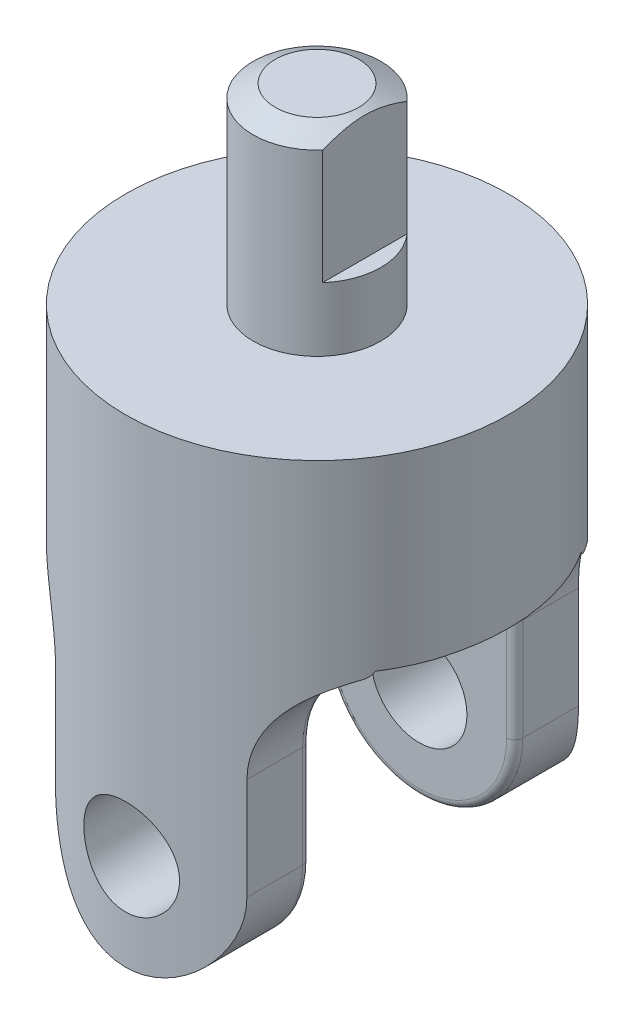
ISO-10303-21;
HEADER;
FILE_DESCRIPTION(('STEP AP214'),'2;1');
FILE_NAME('part.step','',(''),(''),'','','');
FILE_SCHEMA(('AUTOMOTIVE_DESIGN { 1 0 10303 214 1 1 1 1 }'));
ENDSEC;
DATA;
#1=APPLICATION_CONTEXT('core data for automotive mechanical design processes');
#2=APPLICATION_PROTOCOL_DEFINITION('international standard','automotive_design',2000,#1);
#3=PRODUCT_CONTEXT('',#1,'mechanical');
#4=PRODUCT('Part','Part','',(#3));
#5=PRODUCT_RELATED_PRODUCT_CATEGORY('part','',(#4));
#6=PRODUCT_DEFINITION_FORMATION('','',#4);
#7=PRODUCT_DEFINITION_CONTEXT('part definition',#1,'design');
#8=PRODUCT_DEFINITION('design','',#6,#7);
#9=PRODUCT_DEFINITION_SHAPE('','',#8);
#10=(LENGTH_UNIT() NAMED_UNIT(*) SI_UNIT(.MILLI.,.METRE.));
#11=(NAMED_UNIT(*) PLANE_ANGLE_UNIT() SI_UNIT($,.RADIAN.));
#12=(NAMED_UNIT(*) SI_UNIT($,.STERADIAN.) SOLID_ANGLE_UNIT());
#13=UNCERTAINTY_MEASURE_WITH_UNIT(LENGTH_MEASURE(1.E-05),#10,'distance_accuracy_value','');
#14=(GEOMETRIC_REPRESENTATION_CONTEXT(3) GLOBAL_UNCERTAINTY_ASSIGNED_CONTEXT((#13)) GLOBAL_UNIT_ASSIGNED_CONTEXT((#10,
#11,#12)) REPRESENTATION_CONTEXT('',''));
#15=CARTESIAN_POINT('',(0.,0.,0.));
#16=DIRECTION('',(0.,0.,1.));
#17=DIRECTION('',(1.,0.,0.));
#18=AXIS2_PLACEMENT_3D('',#15,#16,#17);
#19=CARTESIAN_POINT('',(0.,66.675,0.));
#20=DIRECTION('',(0.,-1.,0.));
#21=DIRECTION('',(0.,0.,-1.));
#22=AXIS2_PLACEMENT_3D('',#19,#20,#21);
#23=CYLINDRICAL_SURFACE('',#22,6.35);
#24=CARTESIAN_POINT('',(0.,47.625,0.));
#25=DIRECTION('',(0.,1.,0.));
#26=DIRECTION('',(0.,0.,1.));
#27=AXIS2_PLACEMENT_3D('',#24,#25,#26);
#28=CIRCLE('',#27,6.35);
#29=CARTESIAN_POINT('',(0.,47.625,6.35));
#30=VERTEX_POINT('',#29);
#31=EDGE_CURVE('E211',#30,#30,#28,.T.);
#32=ORIENTED_EDGE('',*,*,#31,.T.);
#33=EDGE_LOOP('',(#32));
#34=FACE_BOUND('',#33,.T.);
#35=DIRECTION('',(0.,1.,0.));
#36=VECTOR('',#35,1.);
#37=CARTESIAN_POINT('',(4.7625,53.975,4.20013020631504));
#38=LINE('',#37,#36);
#39=CARTESIAN_POINT('',(4.7625,53.975,4.20013020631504));
#40=VERTEX_POINT('',#39);
#41=CARTESIAN_POINT('',(4.7625,65.405,4.20013020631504));
#42=VERTEX_POINT('',#41);
#43=EDGE_CURVE('E199',#40,#42,#38,.T.);
#44=ORIENTED_EDGE('',*,*,#43,.T.);
#45=CARTESIAN_POINT('',(0.,65.405,0.));
#46=DIRECTION('',(0.,1.,0.));
#47=DIRECTION('',(0.,0.,1.));
#48=AXIS2_PLACEMENT_3D('',#45,#46,#47);
#49=CIRCLE('',#48,6.35);
#50=CARTESIAN_POINT('',(4.7625,65.405,-4.20013020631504));
#51=VERTEX_POINT('',#50);
#52=EDGE_CURVE('E55',#42,#51,#49,.F.);
#53=ORIENTED_EDGE('',*,*,#52,.T.);
#54=DIRECTION('',(0.,1.,0.));
#55=VECTOR('',#54,1.);
#56=CARTESIAN_POINT('',(4.7625,53.975,-4.20013020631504));
#57=LINE('',#56,#55);
#58=CARTESIAN_POINT('',(4.7625,53.975,-4.20013020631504));
#59=VERTEX_POINT('',#58);
#60=EDGE_CURVE('E62',#59,#51,#57,.T.);
#61=ORIENTED_EDGE('',*,*,#60,.F.);
#62=CARTESIAN_POINT('',(0.,53.975,0.));
#63=DIRECTION('',(0.,1.,0.));
#64=DIRECTION('',(0.,0.,1.));
#65=AXIS2_PLACEMENT_3D('',#62,#63,#64);
#66=CIRCLE('',#65,6.35);
#67=EDGE_CURVE('E203',#40,#59,#66,.T.);
#68=ORIENTED_EDGE('',*,*,#67,.F.);
#69=EDGE_LOOP('',(#44,#53,#61,#68));
#70=FACE_BOUND('',#69,.T.);
#71=ADVANCED_FACE('F41',(#34,#70),#23,.T.);
#72=CARTESIAN_POINT('',(0.,66.675,0.));
#73=DIRECTION('',(0.,-1.,0.));
#74=DIRECTION('',(0.,0.,-1.));
#75=AXIS2_PLACEMENT_3D('',#72,#73,#74);
#76=CONICAL_SURFACE('',#75,4.15029547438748,1.0471975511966);
#77=CARTESIAN_POINT('',(0.,66.675,0.));
#78=DIRECTION('',(0.,1.,0.));
#79=DIRECTION('',(0.,0.,1.));
#80=AXIS2_PLACEMENT_3D('',#77,#78,#79);
#81=CIRCLE('',#80,4.15029547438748);
#82=CARTESIAN_POINT('',(0.,66.675,4.15029547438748));
#83=VERTEX_POINT('',#82);
#84=EDGE_CURVE('E522',#83,#83,#81,.T.);
#85=ORIENTED_EDGE('',*,*,#84,.F.);
#86=EDGE_LOOP('',(#85));
#87=FACE_BOUND('',#86,.T.);
#88=ORIENTED_EDGE('',*,*,#52,.F.);
#89=CARTESIAN_POINT('',(4.7625,63.3576640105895,-8.67474438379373));
#90=CARTESIAN_POINT('',(4.7625,63.469711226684,-8.45330719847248));
#91=CARTESIAN_POINT('',(4.7625,63.5810014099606,-8.23148237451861));
#92=CARTESIAN_POINT('',(4.7625,63.8016576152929,-7.7868546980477));
#93=CARTESIAN_POINT('',(4.7625,63.9110234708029,-7.56405176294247));
#94=CARTESIAN_POINT('',(4.7625,64.1277386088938,-7.11660713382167));
#95=CARTESIAN_POINT('',(4.7625,64.2350805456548,-6.89196187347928));
#96=CARTESIAN_POINT('',(4.7625,64.4468042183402,-6.4412857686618));
#97=CARTESIAN_POINT('',(4.7625,64.551186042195,-6.21525496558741));
#98=CARTESIAN_POINT('',(4.7625,64.761300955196,-5.75026984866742));
#99=CARTESIAN_POINT('',(4.7625,64.8668450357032,-5.51122979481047));
#100=CARTESIAN_POINT('',(4.7625,65.0726380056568,-5.03084667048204));
#101=CARTESIAN_POINT('',(4.7625,65.1728864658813,-4.78950341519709));
#102=CARTESIAN_POINT('',(4.7625,65.3663272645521,-4.30430471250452));
#103=CARTESIAN_POINT('',(4.7625,65.4595275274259,-4.06045244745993));
#104=CARTESIAN_POINT('',(4.7625,65.6367537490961,-3.56945984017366));
#105=CARTESIAN_POINT('',(4.7625,65.7207816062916,-3.32232019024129));
#106=CARTESIAN_POINT('',(4.7625,65.8759823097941,-2.82653408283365));
#107=CARTESIAN_POINT('',(4.7625,65.9472687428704,-2.57792372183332));
#108=CARTESIAN_POINT('',(4.7625,66.0743145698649,-2.07671605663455));
#109=CARTESIAN_POINT('',(4.7625,66.1300751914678,-1.82411906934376));
#110=CARTESIAN_POINT('',(4.7625,66.2212225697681,-1.31963718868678));
#111=CARTESIAN_POINT('',(4.7625,66.2569437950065,-1.06781500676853));
#112=CARTESIAN_POINT('',(4.7625,66.2938959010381,-0.688501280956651));
#113=CARTESIAN_POINT('',(4.7625,66.3034417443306,-0.561789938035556));
#114=CARTESIAN_POINT('',(4.7625,66.3167609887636,-0.308068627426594));
#115=CARTESIAN_POINT('',(4.7625,66.3205349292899,-0.181058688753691));
#116=CARTESIAN_POINT('',(4.7625,66.3223134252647,0.0905838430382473));
#117=CARTESIAN_POINT('',(4.7625,66.3194472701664,0.235222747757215));
#118=CARTESIAN_POINT('',(4.7625,66.3061907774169,0.524155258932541));
#119=CARTESIAN_POINT('',(4.7625,66.2958001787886,0.668448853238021));
#120=CARTESIAN_POINT('',(4.7625,66.2678495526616,0.956362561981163));
#121=CARTESIAN_POINT('',(4.7625,66.2502880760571,1.09998253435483));
#122=CARTESIAN_POINT('',(4.7625,66.2085467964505,1.38625029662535));
#123=CARTESIAN_POINT('',(4.7625,66.18436689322,1.52889807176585));
#124=CARTESIAN_POINT('',(4.7625,66.1293852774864,1.81654493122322));
#125=CARTESIAN_POINT('',(4.7625,66.0984351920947,1.96151543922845));
#126=CARTESIAN_POINT('',(4.7625,66.0310411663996,2.25016667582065));
#127=CARTESIAN_POINT('',(4.7625,65.9945971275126,2.39384738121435));
#128=CARTESIAN_POINT('',(4.7625,65.9169451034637,2.67992954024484));
#129=CARTESIAN_POINT('',(4.7625,65.8757364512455,2.82233081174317));
#130=CARTESIAN_POINT('',(4.7625,65.7892365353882,3.10586895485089));
#131=CARTESIAN_POINT('',(4.7625,65.7439455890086,3.24700592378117));
#132=CARTESIAN_POINT('',(4.7625,65.6406667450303,3.55563142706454));
#133=CARTESIAN_POINT('',(4.7625,65.5819291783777,3.72286847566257));
#134=CARTESIAN_POINT('',(4.7625,65.4603269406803,4.05584009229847));
#135=CARTESIAN_POINT('',(4.7625,65.3974619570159,4.22157454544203));
#136=CARTESIAN_POINT('',(4.7625,65.2037410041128,4.71688299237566));
#137=CARTESIAN_POINT('',(4.7625,65.0677927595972,5.04446416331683));
#138=CARTESIAN_POINT('',(4.7625,64.7863691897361,5.69594921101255));
#139=CARTESIAN_POINT('',(4.7625,64.6408818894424,6.01984784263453));
#140=CARTESIAN_POINT('',(4.7625,64.3432582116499,6.66450132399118));
#141=CARTESIAN_POINT('',(4.7625,64.1911228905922,6.98525666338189));
#142=CARTESIAN_POINT('',(4.7625,63.8813253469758,7.62580230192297));
#143=CARTESIAN_POINT('',(4.7625,63.7236419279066,7.9455823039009));
#144=CARTESIAN_POINT('',(4.7625,63.4046196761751,8.58332268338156));
#145=CARTESIAN_POINT('',(4.7625,63.2432807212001,8.90128299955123));
#146=CARTESIAN_POINT('',(4.7625,62.9179416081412,9.53554216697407));
#147=CARTESIAN_POINT('',(4.7625,62.7539434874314,9.85184206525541));
#148=CARTESIAN_POINT('',(4.7625,62.4237848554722,10.4833121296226));
#149=CARTESIAN_POINT('',(4.7625,62.257624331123,10.7984822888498));
#150=CARTESIAN_POINT('',(4.7625,61.8068664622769,11.6479048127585));
#151=CARTESIAN_POINT('',(4.7625,61.5206664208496,12.181306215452));
#152=CARTESIAN_POINT('',(4.7625,60.9448108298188,13.2463803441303));
#153=CARTESIAN_POINT('',(4.7625,60.6551545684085,13.7780526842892));
#154=CARTESIAN_POINT('',(4.7625,60.0757028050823,14.8358326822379));
#155=CARTESIAN_POINT('',(4.7625,59.7859267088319,15.3619509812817));
#156=CARTESIAN_POINT('',(4.7625,59.2046035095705,16.4130517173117));
#157=CARTESIAN_POINT('',(4.7625,58.9130568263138,16.9380343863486));
#158=CARTESIAN_POINT('',(4.7625,58.620879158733,17.4626628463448));
#159=B_SPLINE_CURVE_WITH_KNOTS('',3,(#89,#90,#91,#92,#93,#94,#95,#96,#97,#98,#99,#100,#101,#102,
#103,#104,#105,#106,#107,#108,#109,#110,#111,#112,#113,#114,#115,#116,#117,#118,#119,#120,#121,
#122,#123,#124,#125,#126,#127,#128,#129,#130,#131,#132,#133,#134,#135,#136,#137,#138,#139,#140,
#141,#142,#143,#144,#145,#146,#147,#148,#149,#150,#151,#152,#153,#154,#155,#156,#157,#158),
.UNSPECIFIED.,.F.,.F.,(4,2,2,2,2,2,2,2,2,2,2,2,2,2,2,2,2,2,2,2,2,2,2,2,2,2,2,2,2,2,2,2,2,2,4),
(0.,0.744518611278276,1.48910134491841,2.23600427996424,2.98288500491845,3.76674752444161,
4.55067348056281,5.33370452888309,6.11657320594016,6.89207080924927,7.66750707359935,
8.42958338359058,8.81068147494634,9.19174395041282,9.6255420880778,10.0593552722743,
10.4932561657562,10.927163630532,11.3717539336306,11.8163522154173,12.2610128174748,
12.7056388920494,13.2373268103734,13.7690550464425,14.8328219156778,15.8979507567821,
16.9629109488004,18.0325121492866,19.102149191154,20.1710021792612,21.2398616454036,
23.0558392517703,24.8721975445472,26.6741189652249,28.4756286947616),.UNSPECIFIED.);
#160=EDGE_CURVE('E11',#42,#51,#159,.F.);
#161=ORIENTED_EDGE('',*,*,#160,.T.);
#162=EDGE_LOOP('',(#88,#161));
#163=FACE_BOUND('',#162,.T.);
#164=ADVANCED_FACE('F43',(#87,#163),#76,.T.);
#165=CARTESIAN_POINT('',(0.,47.625,0.));
#166=DIRECTION('',(0.,1.,0.));
#167=DIRECTION('',(0.,0.,1.));
#168=AXIS2_PLACEMENT_3D('',#165,#166,#167);
#169=PLANE('',#168);
#170=CARTESIAN_POINT('',(0.,47.625,0.));
#171=DIRECTION('',(0.,1.,0.));
#172=DIRECTION('',(0.,0.,1.));
#173=AXIS2_PLACEMENT_3D('',#170,#171,#172);
#174=CIRCLE('',#173,19.05);
#175=CARTESIAN_POINT('',(0.,47.625,19.05));
#176=VERTEX_POINT('',#175);
#177=EDGE_CURVE('E580',#176,#176,#174,.T.);
#178=ORIENTED_EDGE('',*,*,#177,.T.);
#179=EDGE_LOOP('',(#178));
#180=FACE_BOUND('',#179,.T.);
#181=ORIENTED_EDGE('',*,*,#31,.F.);
#182=EDGE_LOOP('',(#181));
#183=FACE_BOUND('',#182,.T.);
#184=ADVANCED_FACE('F354',(#180,#183),#169,.T.);
#185=CARTESIAN_POINT('',(0.,47.625,0.));
#186=DIRECTION('',(0.,-1.,0.));
#187=DIRECTION('',(0.,0.,-1.));
#188=AXIS2_PLACEMENT_3D('',#185,#186,#187);
#189=CYLINDRICAL_SURFACE('',#188,19.05);
#190=CARTESIAN_POINT('',(0.,14.2875,-19.05));
#191=CARTESIAN_POINT('',(-0.263131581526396,14.2874926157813,-19.0499955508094));
#192=CARTESIAN_POINT('',(-0.526345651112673,14.2656193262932,-19.0444938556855));
#193=CARTESIAN_POINT('',(-1.04523007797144,14.1788351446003,-19.0230796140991));
#194=CARTESIAN_POINT('',(-1.3008960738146,14.1138998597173,-19.0071611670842));
#195=CARTESIAN_POINT('',(-1.79711626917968,13.9432053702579,-18.966676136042));
#196=CARTESIAN_POINT('',(-2.03768821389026,13.837495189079,-18.9421199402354));
#197=CARTESIAN_POINT('',(-2.49768401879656,13.5884240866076,-18.886974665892));
#198=CARTESIAN_POINT('',(-2.71710716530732,13.4450618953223,-18.8563853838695));
#199=CARTESIAN_POINT('',(-3.13309611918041,13.121637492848,-18.7917903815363));
#200=CARTESIAN_POINT('',(-3.32916431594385,12.940945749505,-18.757731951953));
#201=CARTESIAN_POINT('',(-3.68855284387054,12.5493392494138,-18.6903874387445));
#202=CARTESIAN_POINT('',(-3.85186947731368,12.3384210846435,-18.6571014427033));
#203=CARTESIAN_POINT('',(-4.14345927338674,11.8884851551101,-18.5945391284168));
#204=CARTESIAN_POINT('',(-4.27117578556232,11.6490964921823,-18.5653297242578));
#205=CARTESIAN_POINT('',(-4.48436018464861,11.1513987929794,-18.514996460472));
#206=CARTESIAN_POINT('',(-4.56983482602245,10.8930927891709,-18.4938713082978));
#207=CARTESIAN_POINT('',(-4.69441160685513,10.3703643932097,-18.4626401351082));
#208=CARTESIAN_POINT('',(-4.73440845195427,10.1061682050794,-18.4523218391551));
#209=CARTESIAN_POINT('',(-4.76968113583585,9.57462979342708,-18.443237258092));
#210=CARTESIAN_POINT('',(-4.7649642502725,9.30728808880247,-18.4444690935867));
#211=CARTESIAN_POINT('',(-4.71165721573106,8.78390481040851,-18.4581547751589));
#212=CARTESIAN_POINT('',(-4.66413323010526,8.52774640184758,-18.4703359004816));
#213=CARTESIAN_POINT('',(-4.528261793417,8.02715866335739,-18.5041130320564));
#214=CARTESIAN_POINT('',(-4.43991143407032,7.78273017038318,-18.5257097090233));
#215=CARTESIAN_POINT('',(-4.22398659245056,7.30968179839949,-18.5761348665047));
#216=CARTESIAN_POINT('',(-4.09602516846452,7.08124640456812,-18.6050341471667));
#217=CARTESIAN_POINT('',(-3.80478117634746,6.6487080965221,-18.6667683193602));
#218=CARTESIAN_POINT('',(-3.64149242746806,6.44460944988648,-18.6996038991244));
#219=CARTESIAN_POINT('',(-3.27870637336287,6.06042852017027,-18.7666592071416));
#220=CARTESIAN_POINT('',(-3.07830936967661,5.88119699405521,-18.8008917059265));
#221=CARTESIAN_POINT('',(-2.64989283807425,5.55872255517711,-18.8660394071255));
#222=CARTESIAN_POINT('',(-2.42187246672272,5.41548074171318,-18.8969545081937));
#223=CARTESIAN_POINT('',(-1.94346794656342,5.16873938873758,-18.9521379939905));
#224=CARTESIAN_POINT('',(-1.69300967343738,5.06537804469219,-18.9763831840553));
#225=CARTESIAN_POINT('',(-1.17753132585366,4.90246255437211,-19.0153263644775));
#226=CARTESIAN_POINT('',(-0.912514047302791,4.84290002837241,-19.0300261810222));
#227=CARTESIAN_POINT('',(-0.382714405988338,4.77057222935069,-19.0479521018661));
#228=CARTESIAN_POINT('',(-0.11809958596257,4.75664839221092,-19.0514621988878));
#229=CARTESIAN_POINT('',(0.409679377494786,4.77281558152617,-19.0474220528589));
#230=CARTESIAN_POINT('',(0.67284364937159,4.80290264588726,-19.0398728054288));
#231=CARTESIAN_POINT('',(1.18622530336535,4.90528263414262,-19.0147442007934));
#232=CARTESIAN_POINT('',(1.43657675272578,4.97694351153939,-18.9973151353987));
#233=CARTESIAN_POINT('',(1.92169190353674,5.15971499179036,-18.9543914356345));
#234=CARTESIAN_POINT('',(2.15645402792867,5.27082957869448,-18.928895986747));
#235=CARTESIAN_POINT('',(2.60833595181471,5.5315997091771,-18.8719875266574));
#236=CARTESIAN_POINT('',(2.82506877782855,5.6819041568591,-18.8404775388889));
#237=CARTESIAN_POINT('',(3.23064699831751,6.015957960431,-18.7751881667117));
#238=CARTESIAN_POINT('',(3.41948756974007,6.19971308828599,-18.7414083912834));
#239=CARTESIAN_POINT('',(3.76869505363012,6.60083122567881,-18.6743643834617));
#240=CARTESIAN_POINT('',(3.92824927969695,6.81890845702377,-18.6411331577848));
#241=CARTESIAN_POINT('',(4.20849665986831,7.27942611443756,-18.5798738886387));
#242=CARTESIAN_POINT('',(4.32919153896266,7.5218654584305,-18.5518456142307));
#243=CARTESIAN_POINT('',(4.5273957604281,8.02292566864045,-18.5044745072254));
#244=CARTESIAN_POINT('',(4.60516095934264,8.28144021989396,-18.4850803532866));
#245=CARTESIAN_POINT('',(4.71597247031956,8.80843310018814,-18.457124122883));
#246=CARTESIAN_POINT('',(4.7490285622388,9.0769092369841,-18.4485596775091));
#247=CARTESIAN_POINT('',(4.76897252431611,9.6079342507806,-18.4434131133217));
#248=CARTESIAN_POINT('',(4.75715932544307,9.87043185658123,-18.4464938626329));
#249=CARTESIAN_POINT('',(4.69067285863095,10.3895648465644,-18.4635111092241));
#250=CARTESIAN_POINT('',(4.63600045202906,10.6462003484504,-18.4774473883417));
#251=CARTESIAN_POINT('',(4.48605693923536,11.1449118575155,-18.5144175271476));
#252=CARTESIAN_POINT('',(4.39102945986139,11.3870654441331,-18.5373967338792));
#253=CARTESIAN_POINT('',(4.1632661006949,11.8521650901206,-18.5898712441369));
#254=CARTESIAN_POINT('',(4.03052499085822,12.0751084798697,-18.6193674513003));
#255=CARTESIAN_POINT('',(3.72703010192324,12.5017359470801,-18.6825138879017));
#256=CARTESIAN_POINT('',(3.5553750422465,12.7047659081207,-18.7162524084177));
#257=CARTESIAN_POINT('',(3.18068125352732,13.0795618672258,-18.7835548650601));
#258=CARTESIAN_POINT('',(2.97763508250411,13.2513204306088,-18.8171187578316));
#259=CARTESIAN_POINT('',(2.54148458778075,13.5617309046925,-18.8810155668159));
#260=CARTESIAN_POINT('',(2.30790249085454,13.6997268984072,-18.911278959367));
#261=CARTESIAN_POINT('',(1.82011973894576,13.9342731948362,-18.9644313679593));
#262=CARTESIAN_POINT('',(1.56593401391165,14.0308531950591,-18.9873256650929));
#263=CARTESIAN_POINT('',(1.09350255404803,14.1654905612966,-19.0197758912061));
#264=CARTESIAN_POINT('',(0.877507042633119,14.2111451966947,-19.031032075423));
#265=CARTESIAN_POINT('',(0.441026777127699,14.2721518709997,-19.0461457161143));
#266=CARTESIAN_POINT('',(0.220542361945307,14.2875061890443,-19.0500037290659));
#267=CARTESIAN_POINT('',(0.,14.2875,-19.05));
#268=B_SPLINE_CURVE_WITH_KNOTS('',3,(#190,#191,#192,#193,#194,#195,#196,#197,#198,#199,#200,
#201,#202,#203,#204,#205,#206,#207,#208,#209,#210,#211,#212,#213,#214,#215,#216,#217,#218,#219,
#220,#221,#222,#223,#224,#225,#226,#227,#228,#229,#230,#231,#232,#233,#234,#235,#236,#237,#238,
#239,#240,#241,#242,#243,#244,#245,#246,#247,#248,#249,#250,#251,#252,#253,#254,#255,#256,#257,
#258,#259,#260,#261,#262,#263,#264,#265,#266,#267),.UNSPECIFIED.,.T.,.F.,(4,2,2,2,2,2,2,2,2,2,2,
2,2,2,2,2,2,2,2,2,2,2,2,2,2,2,2,2,2,2,2,2,2,2,2,2,2,2,4),(0.,0.788586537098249,1.57762015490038,
2.36570806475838,3.15382256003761,3.95650832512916,4.75928466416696,5.57398705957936,
6.38855914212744,7.18681236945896,7.98493571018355,8.76371428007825,9.54254833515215,
10.3292442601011,11.1160779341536,11.9253476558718,12.7346420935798,13.5467162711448,
14.3586350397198,15.1497763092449,15.940846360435,16.7201937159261,17.4996197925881,
18.2928764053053,19.08627002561,19.8991381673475,20.7119702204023,21.5199040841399,
22.3276611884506,23.1122150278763,23.8967531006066,24.6766207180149,25.4565965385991,
26.2569190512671,27.0574315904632,27.8724418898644,28.6868668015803,29.3478662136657,
30.008815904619),.UNSPECIFIED.);
#269=CARTESIAN_POINT('',(0.,14.2875,-19.05));
#270=VERTEX_POINT('',#269);
#271=EDGE_CURVE('E228',#270,#270,#268,.T.);
#272=ORIENTED_EDGE('',*,*,#271,.T.);
#273=EDGE_LOOP('',(#272));
#274=FACE_BOUND('',#273,.T.);
#275=CARTESIAN_POINT('',(4.7625,9.525,18.4450831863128));
#276=CARTESIAN_POINT('',(4.7624925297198,9.26201331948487,18.4450882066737));
#277=CARTESIAN_POINT('',(4.74064249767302,8.99894396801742,18.4507690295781));
#278=CARTESIAN_POINT('',(4.65395905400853,8.48035976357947,18.4728204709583));
#279=CARTESIAN_POINT('',(4.58910062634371,8.22484939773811,18.4891973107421));
#280=CARTESIAN_POINT('',(4.41863073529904,7.72895925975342,18.5306727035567));
#281=CARTESIAN_POINT('',(4.31307188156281,7.48856041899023,18.5557599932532));
#282=CARTESIAN_POINT('',(4.06435777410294,7.02885782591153,18.6118155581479));
#283=CARTESIAN_POINT('',(3.92120092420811,6.80955496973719,18.6427840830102));
#284=CARTESIAN_POINT('',(3.59798955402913,6.39344356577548,18.7078756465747));
#285=CARTESIAN_POINT('',(3.41725927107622,6.19716769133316,18.7420490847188));
#286=CARTESIAN_POINT('',(3.02548683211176,5.83737454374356,18.8092627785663));
#287=CARTESIAN_POINT('',(2.81444184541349,5.67386033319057,18.8423029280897));
#288=CARTESIAN_POINT('',(2.36438160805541,5.38205273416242,18.9040849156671));
#289=CARTESIAN_POINT('',(2.12501716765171,5.25428263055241,18.9327603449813));
#290=CARTESIAN_POINT('',(1.62737136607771,5.04099262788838,18.98200696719));
#291=CARTESIAN_POINT('',(1.36909280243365,4.95546649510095,19.0025793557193));
#292=CARTESIAN_POINT('',(0.846503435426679,4.8307983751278,19.0329456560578));
#293=CARTESIAN_POINT('',(0.582420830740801,4.79075182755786,19.0429494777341));
#294=CARTESIAN_POINT('',(0.0511089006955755,4.75534028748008,19.0517829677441));
#295=CARTESIAN_POINT('',(-0.216119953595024,4.75996868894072,19.0506142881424));
#296=CARTESIAN_POINT('',(-0.739865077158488,4.81312508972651,19.0373907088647));
#297=CARTESIAN_POINT('',(-0.996487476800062,4.86067669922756,19.0255779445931));
#298=CARTESIAN_POINT('',(-1.4979884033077,4.99676026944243,18.992675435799));
#299=CARTESIAN_POINT('',(-1.74286630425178,5.08529441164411,18.9715851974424));
#300=CARTESIAN_POINT('',(-2.21649942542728,5.30161989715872,18.9221270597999));
#301=CARTESIAN_POINT('',(-2.44508897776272,5.42975872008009,18.8936951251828));
#302=CARTESIAN_POINT('',(-2.87786265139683,5.72139256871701,18.8326376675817));
#303=CARTESIAN_POINT('',(-3.08204251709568,5.88489374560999,18.8000114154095));
#304=CARTESIAN_POINT('',(-3.46602384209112,6.24784515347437,18.733078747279));
#305=CARTESIAN_POINT('',(-3.6450159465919,6.44814856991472,18.6987507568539));
#306=CARTESIAN_POINT('',(-3.96704999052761,6.87628794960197,18.6330915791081));
#307=CARTESIAN_POINT('',(-4.11009024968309,7.10412519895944,18.6017605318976));
#308=CARTESIAN_POINT('',(-4.35667846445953,7.58245251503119,18.5455654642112));
#309=CARTESIAN_POINT('',(-4.46003156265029,7.8330470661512,18.5207335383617));
#310=CARTESIAN_POINT('',(-4.6228902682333,8.34882531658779,18.4807600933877));
#311=CARTESIAN_POINT('',(-4.68240525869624,8.61400588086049,18.4656165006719));
#312=CARTESIAN_POINT('',(-4.75455546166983,9.14392285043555,18.4471695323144));
#313=CARTESIAN_POINT('',(-4.76838735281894,9.40848599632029,18.4435639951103));
#314=CARTESIAN_POINT('',(-4.75205486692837,9.93614078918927,18.4477788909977));
#315=CARTESIAN_POINT('',(-4.72189453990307,10.1992325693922,18.4555982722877));
#316=CARTESIAN_POINT('',(-4.61948300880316,10.7120326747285,18.4814924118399));
#317=CARTESIAN_POINT('',(-4.54792855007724,10.9618895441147,18.4993972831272));
#318=CARTESIAN_POINT('',(-4.36553244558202,11.4460619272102,18.5432836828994));
#319=CARTESIAN_POINT('',(-4.25468614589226,11.6803755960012,18.5692661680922));
#320=CARTESIAN_POINT('',(-3.99434812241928,12.1318806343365,18.6270164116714));
#321=CARTESIAN_POINT('',(-3.84414094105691,12.3486459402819,18.6588876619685));
#322=CARTESIAN_POINT('',(-3.51024964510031,12.7543338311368,18.7245704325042));
#323=CARTESIAN_POINT('',(-3.3265600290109,12.9432518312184,18.7583822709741));
#324=CARTESIAN_POINT('',(-2.92542620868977,13.2927300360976,18.8251605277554));
#325=CARTESIAN_POINT('',(-2.70725242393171,13.4524624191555,18.8580846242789));
#326=CARTESIAN_POINT('',(-2.24648402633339,13.7330228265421,18.9185019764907));
#327=CARTESIAN_POINT('',(-2.00389068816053,13.8538528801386,18.9459955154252));
#328=CARTESIAN_POINT('',(-1.50284593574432,14.0521296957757,18.9922807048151));
#329=CARTESIAN_POINT('',(-1.24452402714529,14.1298884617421,19.0111347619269));
#330=CARTESIAN_POINT('',(-0.717945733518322,14.240751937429,19.0382898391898));
#331=CARTESIAN_POINT('',(-0.449691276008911,14.2738652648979,19.0465928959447));
#332=CARTESIAN_POINT('',(0.0813602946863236,14.2940131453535,19.0516273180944));
#333=CARTESIAN_POINT('',(0.344108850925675,14.2822693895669,19.0486654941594));
#334=CARTESIAN_POINT('',(0.863762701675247,14.2158347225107,19.0321833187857));
#335=CARTESIAN_POINT('',(1.12066816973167,14.1611450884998,19.0186632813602));
#336=CARTESIAN_POINT('',(1.62006455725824,14.0110263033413,18.9826312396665));
#337=CARTESIAN_POINT('',(1.86262563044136,13.9158180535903,18.9601680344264));
#338=CARTESIAN_POINT('',(2.32846746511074,13.6875651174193,18.908615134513));
#339=CARTESIAN_POINT('',(2.55174579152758,13.5545156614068,18.8795246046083));
#340=CARTESIAN_POINT('',(2.97847668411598,13.2506311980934,18.8169827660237));
#341=CARTESIAN_POINT('',(3.18132613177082,13.0789673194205,18.7834436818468));
#342=CARTESIAN_POINT('',(3.55575403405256,12.7043361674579,18.7161796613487));
#343=CARTESIAN_POINT('',(3.72732454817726,12.5013609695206,18.6824546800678));
#344=CARTESIAN_POINT('',(4.0374666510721,12.0653107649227,18.6179210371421));
#345=CARTESIAN_POINT('',(4.1753628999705,11.831744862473,18.5871785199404));
#346=CARTESIAN_POINT('',(4.4097268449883,11.3440107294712,18.5329808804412));
#347=CARTESIAN_POINT('',(4.50622468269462,11.0898576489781,18.5095204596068));
#348=CARTESIAN_POINT('',(4.6406872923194,10.617626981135,18.4762096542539));
#349=CARTESIAN_POINT('',(4.68626747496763,10.401808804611,18.4646250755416));
#350=CARTESIAN_POINT('',(4.74717566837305,9.96567951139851,18.4490600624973));
#351=CARTESIAN_POINT('',(4.76250625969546,9.74536877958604,18.4450789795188));
#352=CARTESIAN_POINT('',(4.7625,9.525,18.4450831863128));
#353=B_SPLINE_CURVE_WITH_KNOTS('',3,(#275,#276,#277,#278,#279,#280,#281,#282,#283,#284,#285,
#286,#287,#288,#289,#290,#291,#292,#293,#294,#295,#296,#297,#298,#299,#300,#301,#302,#303,#304,
#305,#306,#307,#308,#309,#310,#311,#312,#313,#314,#315,#316,#317,#318,#319,#320,#321,#322,#323,
#324,#325,#326,#327,#328,#329,#330,#331,#332,#333,#334,#335,#336,#337,#338,#339,#340,#341,#342,
#343,#344,#345,#346,#347,#348,#349,#350,#351,#352),.UNSPECIFIED.,.T.,.F.,(4,2,2,2,2,2,2,2,2,2,2,
2,2,2,2,2,2,2,2,2,2,2,2,2,2,2,2,2,2,2,2,2,2,2,2,2,2,2,4),(0.,0.788150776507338,1.57676038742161,
2.36435403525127,3.15198112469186,3.95523632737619,4.75856658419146,5.57310600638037,
6.3875251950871,7.18544570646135,7.98324823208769,8.76334790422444,9.54348910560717,
10.3306792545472,11.1180064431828,11.9266423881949,12.7353161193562,13.5479110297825,
14.3603319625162,15.1512950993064,15.9421854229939,16.7201355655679,17.4981778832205,
18.2914832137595,19.0849190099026,19.8982075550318,20.7114536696,21.5187289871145,
22.3258484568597,23.1111446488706,23.896417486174,24.677462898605,25.4586067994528,
26.258464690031,27.0585253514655,27.8735118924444,28.6879040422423,29.3483886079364,
30.0088168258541),.UNSPECIFIED.);
#354=CARTESIAN_POINT('',(4.7625,9.525,18.4450831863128));
#355=VERTEX_POINT('',#354);
#356=EDGE_CURVE('E220',#355,#355,#353,.T.);
#357=ORIENTED_EDGE('',*,*,#356,.T.);
#358=EDGE_LOOP('',(#357));
#359=FACE_BOUND('',#358,.T.);
#360=ORIENTED_EDGE('',*,*,#177,.F.);
#361=EDGE_LOOP('',(#360));
#362=FACE_BOUND('',#361,.T.);
#363=CARTESIAN_POINT('',(0.,29.1452388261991,0.));
#364=DIRECTION('',(0.,1.,0.));
#365=DIRECTION('',(0.,0.,1.));
#366=AXIS2_PLACEMENT_3D('',#363,#364,#365);
#367=CIRCLE('',#366,19.05);
#368=CARTESIAN_POINT('',(-17.9411689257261,29.1452388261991,6.40444826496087));
#369=VERTEX_POINT('',#368);
#370=CARTESIAN_POINT('',(-16.0465941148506,29.1452388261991,10.2669039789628));
#371=VERTEX_POINT('',#370);
#372=EDGE_CURVE('E587',#369,#371,#367,.T.);
#373=ORIENTED_EDGE('',*,*,#372,.T.);
#374=CARTESIAN_POINT('',(-16.0465941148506,29.1452388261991,10.2669039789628));
#375=CARTESIAN_POINT('',(-16.03727687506,29.1157831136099,10.2814663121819));
#376=CARTESIAN_POINT('',(-16.0271745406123,29.0872011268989,10.2972119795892));
#377=CARTESIAN_POINT('',(-16.0055557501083,29.0318945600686,10.3307833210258));
#378=CARTESIAN_POINT('',(-15.9940408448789,29.0051679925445,10.3486067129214));
#379=CARTESIAN_POINT('',(-15.9576708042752,28.9280401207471,10.4046726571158));
#380=CARTESIAN_POINT('',(-15.9309167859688,28.8804640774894,10.4456265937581));
#381=CARTESIAN_POINT('',(-15.8742304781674,28.7948098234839,10.5315660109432));
#382=CARTESIAN_POINT('',(-15.8444182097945,28.7564886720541,10.5763928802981));
#383=CARTESIAN_POINT('',(-15.7816164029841,28.6878878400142,10.6698758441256));
#384=CARTESIAN_POINT('',(-15.7486256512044,28.6576112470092,10.7185333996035));
#385=CARTESIAN_POINT('',(-15.6930675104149,28.6155571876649,10.7996090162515));
#386=CARTESIAN_POINT('',(-15.67127965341,28.6011148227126,10.8312051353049));
#387=CARTESIAN_POINT('',(-15.6268999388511,28.575819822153,10.8951372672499));
#388=CARTESIAN_POINT('',(-15.6043100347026,28.5649590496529,10.9274714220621));
#389=CARTESIAN_POINT('',(-15.5813577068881,28.5559720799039,10.9601));
#390=B_SPLINE_CURVE_WITH_KNOTS('',3,(#374,#375,#376,#377,#378,#379,#380,#381,#382,#383,#384,
#385,#386,#387,#388,#389),.UNSPECIFIED.,.F.,.F.,(4,2,2,2,2,2,2,4),(0.,0.102363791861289,
0.204616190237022,0.408337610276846,0.605922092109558,0.803582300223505,0.926449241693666,
1.04903509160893),.UNSPECIFIED.);
#391=CARTESIAN_POINT('',(-15.5813577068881,28.5559720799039,10.9601));
#392=VERTEX_POINT('',#391);
#393=EDGE_CURVE('E322',#371,#392,#390,.T.);
#394=ORIENTED_EDGE('',*,*,#393,.T.);
#395=CARTESIAN_POINT('',(-9.525,19.685,-16.4977839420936));
#396=CARTESIAN_POINT('',(-9.52496088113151,19.918350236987,-16.4977688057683));
#397=CARTESIAN_POINT('',(-9.53357353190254,20.1516967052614,-16.4928328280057));
#398=CARTESIAN_POINT('',(-9.56782146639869,20.6166980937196,-16.4730087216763));
#399=CARTESIAN_POINT('',(-9.59345572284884,20.8483531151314,-16.4581211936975));
#400=CARTESIAN_POINT('',(-9.66141942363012,21.3080009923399,-16.4183108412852));
#401=CARTESIAN_POINT('',(-9.70372594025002,21.5359984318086,-16.3934017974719));
#402=CARTESIAN_POINT('',(-9.80447669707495,21.9870210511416,-16.3333461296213));
#403=CARTESIAN_POINT('',(-9.86292069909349,22.2100463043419,-16.2981996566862));
#404=CARTESIAN_POINT('',(-9.99521577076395,22.6496636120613,-16.217402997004));
#405=CARTESIAN_POINT('',(-10.0690752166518,22.8662520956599,-16.1717470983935));
#406=CARTESIAN_POINT('',(-10.2311827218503,23.2913603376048,-16.0696785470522));
#407=CARTESIAN_POINT('',(-10.3194309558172,23.4998799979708,-16.0132657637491));
#408=CARTESIAN_POINT('',(-10.5090589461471,23.9073731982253,-15.8894615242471));
#409=CARTESIAN_POINT('',(-10.6104339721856,24.1063501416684,-15.8220740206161));
#410=CARTESIAN_POINT('',(-10.8249101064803,24.4935871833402,-15.676116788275));
#411=CARTESIAN_POINT('',(-10.9380111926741,24.6818473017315,-15.597547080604));
#412=CARTESIAN_POINT('',(-11.1750060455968,25.0476354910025,-15.4286429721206));
#413=CARTESIAN_POINT('',(-11.2989577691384,25.2250961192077,-15.3382439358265));
#414=CARTESIAN_POINT('',(-11.5553164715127,25.5672655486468,-15.1460495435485));
#415=CARTESIAN_POINT('',(-11.6877234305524,25.7319743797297,-15.0442542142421));
#416=CARTESIAN_POINT('',(-11.9591574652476,26.0480960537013,-14.8293967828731));
#417=CARTESIAN_POINT('',(-12.0981857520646,26.1995064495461,-14.7163326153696));
#418=CARTESIAN_POINT('',(-12.3809708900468,26.4887188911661,-14.4792302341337));
#419=CARTESIAN_POINT('',(-12.5247282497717,26.6265194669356,-14.3551908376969));
#420=CARTESIAN_POINT('',(-12.8240785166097,26.8965620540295,-14.0885806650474));
#421=CARTESIAN_POINT('',(-12.9798547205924,27.0279377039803,-13.9453388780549));
#422=CARTESIAN_POINT('',(-13.292575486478,27.2756182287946,-13.6475843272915));
#423=CARTESIAN_POINT('',(-13.4495200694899,27.3919228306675,-13.4930713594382));
#424=CARTESIAN_POINT('',(-13.7627279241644,27.6100750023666,-13.1734537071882));
#425=CARTESIAN_POINT('',(-13.91899104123,27.7119194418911,-13.0083467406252));
#426=CARTESIAN_POINT('',(-14.2291584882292,27.9019462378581,-12.6683290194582));
#427=CARTESIAN_POINT('',(-14.3830623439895,27.9901258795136,-12.4934163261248));
#428=CARTESIAN_POINT('',(-14.7634251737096,28.1948863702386,-12.0444336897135));
#429=CARTESIAN_POINT('',(-14.9875078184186,28.3034922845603,-11.7646791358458));
#430=CARTESIAN_POINT('',(-15.4232003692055,28.4957157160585,-11.1874194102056));
#431=CARTESIAN_POINT('',(-15.6348051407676,28.5793230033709,-10.8899070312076));
#432=CARTESIAN_POINT('',(-16.0431146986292,28.7255421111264,-10.2789237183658));
#433=CARTESIAN_POINT('',(-16.2397846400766,28.7881059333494,-9.96541815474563));
#434=CARTESIAN_POINT('',(-16.615638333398,28.8957388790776,-9.3252837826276));
#435=CARTESIAN_POINT('',(-16.7948218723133,28.9408077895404,-8.99865481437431));
#436=CARTESIAN_POINT('',(-17.1918461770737,29.029905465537,-8.22145899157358));
#437=CARTESIAN_POINT('',(-17.4021973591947,29.0684013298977,-7.76641658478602));
#438=CARTESIAN_POINT('',(-17.786699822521,29.1278564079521,-6.84014068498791));
#439=CARTESIAN_POINT('',(-17.9608394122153,29.1488099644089,-6.36890201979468));
#440=CARTESIAN_POINT('',(-18.2714417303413,29.1794105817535,-5.41378881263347));
#441=CARTESIAN_POINT('',(-18.4079009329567,29.1890565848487,-4.92991309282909));
#442=CARTESIAN_POINT('',(-18.6421466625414,29.2019870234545,-3.95287775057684));
#443=CARTESIAN_POINT('',(-18.7399368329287,29.2052720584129,-3.45971900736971));
#444=CARTESIAN_POINT('',(-18.897358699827,29.2091078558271,-2.4600813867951));
#445=CARTESIAN_POINT('',(-18.9564226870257,29.2096187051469,-1.95351291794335));
#446=CARTESIAN_POINT('',(-19.033752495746,29.2100647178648,-0.937263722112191));
#447=CARTESIAN_POINT('',(-19.0520174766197,29.209999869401,-0.427582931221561));
#448=CARTESIAN_POINT('',(-19.0476285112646,29.2100001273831,0.591825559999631));
#449=CARTESIAN_POINT('',(-19.0249568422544,29.2100652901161,1.10155318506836));
#450=CARTESIAN_POINT('',(-18.9388075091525,29.2094475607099,2.11754548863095));
#451=CARTESIAN_POINT('',(-18.8753295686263,29.2087646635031,2.62381014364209));
#452=CARTESIAN_POINT('',(-18.7036160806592,29.2041086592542,3.65580332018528));
#453=CARTESIAN_POINT('',(-18.5932233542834,29.1999661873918,4.18117378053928));
#454=CARTESIAN_POINT('',(-18.3285057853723,29.1835599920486,5.2207365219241));
#455=CARTESIAN_POINT('',(-18.1741722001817,29.1712946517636,5.73492655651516));
#456=CARTESIAN_POINT('',(-17.8230306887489,29.1322930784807,6.74751648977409));
#457=CARTESIAN_POINT('',(-17.6262637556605,29.1055707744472,7.24593109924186));
#458=CARTESIAN_POINT('',(-17.1921907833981,29.0296619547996,8.22291578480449));
#459=CARTESIAN_POINT('',(-16.9549063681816,28.9804873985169,8.7014962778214));
#460=CARTESIAN_POINT('',(-16.5317482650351,28.8726944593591,9.47232063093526));
#461=CARTESIAN_POINT('',(-16.356505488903,28.8232353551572,9.77172744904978));
#462=CARTESIAN_POINT('',(-15.9915321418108,28.7076409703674,10.3582119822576));
#463=CARTESIAN_POINT('',(-15.8018055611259,28.6415102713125,10.6452930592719));
#464=CARTESIAN_POINT('',(-15.4100602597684,28.4895738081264,11.2048655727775));
#465=CARTESIAN_POINT('',(-15.2080616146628,28.4037995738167,11.4773795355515));
#466=CARTESIAN_POINT('',(-14.794100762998,28.2093882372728,12.0062371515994));
#467=CARTESIAN_POINT('',(-14.5821407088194,28.1007560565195,12.2625842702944));
#468=CARTESIAN_POINT('',(-14.1961331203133,27.8828084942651,12.7059055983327));
#469=CARTESIAN_POINT('',(-14.0232896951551,27.7782615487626,12.8962780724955));
#470=CARTESIAN_POINT('',(-13.6756323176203,27.5516907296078,13.2643740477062));
#471=CARTESIAN_POINT('',(-13.5008188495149,27.4296710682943,13.4421005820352));
#472=CARTESIAN_POINT('',(-13.1516762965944,27.1671845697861,13.7838888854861));
#473=CARTESIAN_POINT('',(-12.9773471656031,27.0267195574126,13.947952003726));
#474=CARTESIAN_POINT('',(-12.6319391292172,26.726763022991,14.2615225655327));
#475=CARTESIAN_POINT('',(-12.4608602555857,26.5672713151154,14.4110298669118));
#476=CARTESIAN_POINT('',(-12.1237135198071,26.2279198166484,14.6958204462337));
#477=CARTESIAN_POINT('',(-11.9576926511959,26.0479167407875,14.8309890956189));
#478=CARTESIAN_POINT('',(-11.6351953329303,25.6689938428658,15.0853214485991));
#479=CARTESIAN_POINT('',(-11.4787191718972,25.4700734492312,15.2044846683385));
#480=CARTESIAN_POINT('',(-11.1784747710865,25.0543983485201,15.4265708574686));
#481=CARTESIAN_POINT('',(-11.0347050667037,24.8376457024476,15.5294956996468));
#482=CARTESIAN_POINT('',(-10.7628059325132,24.3878782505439,15.7191604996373));
#483=CARTESIAN_POINT('',(-10.6346741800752,24.154865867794,15.8059028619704));
#484=CARTESIAN_POINT('',(-10.4115375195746,23.7046522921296,15.9536199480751));
#485=CARTESIAN_POINT('',(-10.3143937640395,23.4891174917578,16.0164604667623));
#486=CARTESIAN_POINT('',(-10.1355425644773,23.04871010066,16.1302361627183));
#487=CARTESIAN_POINT('',(-10.0538339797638,22.8238382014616,16.181172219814));
#488=CARTESIAN_POINT('',(-9.90713729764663,22.3666546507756,16.2714028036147));
#489=CARTESIAN_POINT('',(-9.84213485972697,22.1343495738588,16.3107073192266));
#490=CARTESIAN_POINT('',(-9.72972257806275,21.6640173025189,16.3780123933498));
#491=CARTESIAN_POINT('',(-9.6823065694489,21.4259921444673,16.4060169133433));
#492=CARTESIAN_POINT('',(-9.60449707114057,20.9383691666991,16.4516946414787));
#493=CARTESIAN_POINT('',(-9.57468865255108,20.6886433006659,16.4690135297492));
#494=CARTESIAN_POINT('',(-9.54488066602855,20.3127872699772,16.48629321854));
#495=CARTESIAN_POINT('',(-9.5374287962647,20.1873921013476,16.4906033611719));
#496=CARTESIAN_POINT('',(-9.52748802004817,19.9363374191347,16.4963477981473));
#497=CARTESIAN_POINT('',(-9.52499919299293,19.8106779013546,16.4977820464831));
#498=CARTESIAN_POINT('',(-9.525,19.685,16.4977839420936));
#499=B_SPLINE_CURVE_WITH_KNOTS('',3,(#395,#396,#397,#398,#399,#400,#401,#402,#403,#404,#405,
#406,#407,#408,#409,#410,#411,#412,#413,#414,#415,#416,#417,#418,#419,#420,#421,#422,#423,#424,
#425,#426,#427,#428,#429,#430,#431,#432,#433,#434,#435,#436,#437,#438,#439,#440,#441,#442,#443,
#444,#445,#446,#447,#448,#449,#450,#451,#452,#453,#454,#455,#456,#457,#458,#459,#460,#461,#462,
#463,#464,#465,#466,#467,#468,#469,#470,#471,#472,#473,#474,#475,#476,#477,#478,#479,#480,#481,
#482,#483,#484,#485,#486,#487,#488,#489,#490,#491,#492,#493,#494,#495,#496,#497,#498),
.UNSPECIFIED.,.F.,.F.,(4,2,2,2,2,2,2,2,2,2,2,2,2,2,2,2,2,2,2,2,2,2,2,2,2,2,2,2,2,2,2,2,2,2,2,2,
2,2,2,2,2,2,2,2,2,2,2,2,2,2,2,4),(0.,0.699834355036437,1.39962647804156,2.09845958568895,
2.79728237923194,3.49648588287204,4.19569787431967,4.8946585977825,5.59361800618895,
6.29656980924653,6.99951996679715,7.70259920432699,8.40575429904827,9.15225685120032,
9.89877292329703,10.6454503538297,11.3922759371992,12.514141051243,13.6364646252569,
14.7613310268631,15.8862111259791,17.392458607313,18.899191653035,20.40606563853,
21.9127976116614,23.4411511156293,24.9695361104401,26.4985829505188,28.0276401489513,
29.6362655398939,31.2452112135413,32.852609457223,34.4591525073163,35.50965675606,
36.5598726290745,37.6084144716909,38.6567307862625,39.4886840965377,40.3204371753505,
41.1521080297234,41.9837870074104,42.8216802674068,43.6595988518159,44.4974207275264,
45.3351180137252,46.0680642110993,46.8009562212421,47.5332170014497,48.2652208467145,
49.02034913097,49.3973072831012,49.7742714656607),.UNSPECIFIED.);
#500=CARTESIAN_POINT('',(-9.525,19.685,16.4977839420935));
#501=VERTEX_POINT('',#500);
#502=EDGE_CURVE('E389',#392,#501,#499,.T.);
#503=ORIENTED_EDGE('',*,*,#502,.T.);
#504=DIRECTION('',(0.,-1.,0.));
#505=VECTOR('',#504,1.);
#506=CARTESIAN_POINT('',(-9.52499999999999,47.625,16.4977839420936));
#507=LINE('',#506,#505);
#508=CARTESIAN_POINT('',(-9.525,9.525,16.4977839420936));
#509=VERTEX_POINT('',#508);
#510=EDGE_CURVE('E390',#501,#509,#507,.T.);
#511=ORIENTED_EDGE('',*,*,#510,.T.);
#512=CARTESIAN_POINT('',(9.525,9.525,16.4977839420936));
#513=CARTESIAN_POINT('',(9.52500093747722,9.40027257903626,16.4977810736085));
#514=CARTESIAN_POINT('',(9.5225495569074,9.27556275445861,16.4991989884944));
#515=CARTESIAN_POINT('',(9.51275833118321,9.02640408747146,16.504847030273));
#516=CARTESIAN_POINT('',(9.50541869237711,8.90195523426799,16.5090770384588));
#517=CARTESIAN_POINT('',(9.47610793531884,8.52953393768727,16.5259318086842));
#518=CARTESIAN_POINT('',(9.4468449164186,8.28227418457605,16.5427214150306));
#519=CARTESIAN_POINT('',(9.36949132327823,7.79316834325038,16.5866536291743));
#520=CARTESIAN_POINT('',(9.32150961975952,7.55129934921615,16.6137363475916));
#521=CARTESIAN_POINT('',(9.20730560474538,7.07314911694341,16.6772985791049));
#522=CARTESIAN_POINT('',(9.14108119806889,6.83686852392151,16.7137791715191));
#523=CARTESIAN_POINT('',(8.99129510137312,6.37194751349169,16.7948306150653));
#524=CARTESIAN_POINT('',(8.90777526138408,6.14329017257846,16.8393819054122));
#525=CARTESIAN_POINT('',(8.72407711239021,5.69420111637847,16.9352799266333));
#526=CARTESIAN_POINT('',(8.62389244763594,5.47377257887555,16.9866292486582));
#527=CARTESIAN_POINT('',(8.29930376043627,4.82601405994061,17.1488381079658));
#528=CARTESIAN_POINT('',(8.05095104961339,4.41247529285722,17.2678097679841));
#529=CARTESIAN_POINT('',(7.47383610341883,3.59736922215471,17.5257462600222));
#530=CARTESIAN_POINT('',(7.14015861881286,3.19954734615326,17.6655504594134));
#531=CARTESIAN_POINT('',(6.5945742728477,2.64718480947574,17.8732248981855));
#532=CARTESIAN_POINT('',(6.40509661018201,2.47038257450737,17.9421446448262));
#533=CARTESIAN_POINT('',(6.01181385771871,2.13237428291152,18.0777156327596));
#534=CARTESIAN_POINT('',(5.80800671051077,1.97117047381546,18.1443665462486));
#535=CARTESIAN_POINT('',(5.3727806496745,1.65505544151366,18.2781569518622));
#536=CARTESIAN_POINT('',(5.14042653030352,1.50131409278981,18.3450225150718));
#537=CARTESIAN_POINT('',(4.66194023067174,1.21417930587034,18.4724136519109));
#538=CARTESIAN_POINT('',(4.41581396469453,1.08077722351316,18.5329419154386));
#539=CARTESIAN_POINT('',(3.91130485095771,0.835583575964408,18.6459377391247));
#540=CARTESIAN_POINT('',(3.65292491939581,0.723786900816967,18.6984072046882));
#541=CARTESIAN_POINT('',(3.1257193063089,0.523053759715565,18.7937250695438));
#542=CARTESIAN_POINT('',(2.85689473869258,0.434114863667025,18.8365744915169));
#543=CARTESIAN_POINT('',(2.33040396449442,0.2857231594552,18.9086545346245));
#544=CARTESIAN_POINT('',(2.07330466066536,0.224622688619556,18.9386372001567));
#545=CARTESIAN_POINT('',(1.55394863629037,0.123892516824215,18.9883061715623));
#546=CARTESIAN_POINT('',(1.29169214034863,0.0842618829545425,19.0079929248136));
#547=CARTESIAN_POINT('',(0.76432935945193,0.0270138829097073,19.0364912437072));
#548=CARTESIAN_POINT('',(0.499224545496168,0.00938565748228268,19.0453081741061));
#549=CARTESIAN_POINT('',(-0.0316607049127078,-0.00364684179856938,19.0518227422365));
#550=CARTESIAN_POINT('',(-0.297441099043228,0.000947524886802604,19.0495210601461));
#551=CARTESIAN_POINT('',(-0.804260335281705,0.0309220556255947,19.0345541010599));
#552=CARTESIAN_POINT('',(-1.04543822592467,0.0544573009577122,19.0228087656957));
#553=CARTESIAN_POINT('',(-1.52469707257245,0.119714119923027,18.9904047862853));
#554=CARTESIAN_POINT('',(-1.76277824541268,0.161434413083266,18.9697467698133));
#555=CARTESIAN_POINT('',(-2.23423979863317,0.262606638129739,18.9200123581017));
#556=CARTESIAN_POINT('',(-2.46762011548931,0.322058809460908,18.8909358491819));
#557=CARTESIAN_POINT('',(-2.92820911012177,0.458088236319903,18.8250425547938));
#558=CARTESIAN_POINT('',(-3.15541756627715,0.534666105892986,18.7882254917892));
#559=CARTESIAN_POINT('',(-3.60539303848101,0.705394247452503,18.7071268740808));
#560=CARTESIAN_POINT('',(-3.82805781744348,0.799769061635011,18.662750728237));
#561=CARTESIAN_POINT('',(-4.26455258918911,1.00458926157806,18.5678772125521));
#562=CARTESIAN_POINT('',(-4.47837941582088,1.11504034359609,18.51737767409));
#563=CARTESIAN_POINT('',(-5.10493628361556,1.46924131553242,18.3583058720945));
#564=CARTESIAN_POINT('',(-5.50300713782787,1.73594015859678,18.2421108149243));
#565=CARTESIAN_POINT('',(-6.28824042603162,2.35173975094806,17.9874060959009));
#566=CARTESIAN_POINT('',(-6.67082158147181,2.70624414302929,17.8478253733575));
#567=CARTESIAN_POINT('',(-7.19758780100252,3.28095380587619,17.638966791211));
#568=CARTESIAN_POINT('',(-7.36544169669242,3.47985996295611,17.5693768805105));
#569=CARTESIAN_POINT('',(-7.68466910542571,3.89124176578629,17.4321111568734));
#570=CARTESIAN_POINT('',(-7.83604008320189,4.10371949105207,17.3644356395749));
#571=CARTESIAN_POINT('',(-8.13051871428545,4.55533319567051,17.2286143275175));
#572=CARTESIAN_POINT('',(-8.27246277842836,4.79530464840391,17.1607200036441));
#573=CARTESIAN_POINT('',(-8.53533313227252,5.28806294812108,17.0315012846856));
#574=CARTESIAN_POINT('',(-8.65626905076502,5.5408438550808,16.9701738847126));
#575=CARTESIAN_POINT('',(-8.87577538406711,6.05731622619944,16.856404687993));
#576=CARTESIAN_POINT('',(-8.97438588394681,6.32098711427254,16.8039470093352));
#577=CARTESIAN_POINT('',(-9.14827185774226,6.85774586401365,16.7099199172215));
#578=CARTESIAN_POINT('',(-9.22355744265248,7.13082958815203,16.6683457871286));
#579=CARTESIAN_POINT('',(-9.32597272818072,7.57995506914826,16.6111629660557));
#580=CARTESIAN_POINT('',(-9.36056268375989,7.75384156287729,16.5916705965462));
#581=CARTESIAN_POINT('',(-9.42003837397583,8.10374181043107,16.5579753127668));
#582=CARTESIAN_POINT('',(-9.44492679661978,8.27975496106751,16.5437709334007));
#583=CARTESIAN_POINT('',(-9.4848665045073,8.63355937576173,16.5209069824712));
#584=CARTESIAN_POINT('',(-9.49990078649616,8.81135317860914,16.5122569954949));
#585=CARTESIAN_POINT('',(-9.51997579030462,9.16776164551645,16.5006843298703));
#586=CARTESIAN_POINT('',(-9.52501242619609,9.34637661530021,16.4977639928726));
#587=CARTESIAN_POINT('',(-9.525,9.525,16.4977839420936));
#588=B_SPLINE_CURVE_WITH_KNOTS('',3,(#512,#513,#514,#515,#516,#517,#518,#519,#520,#521,#522,
#523,#524,#525,#526,#527,#528,#529,#530,#531,#532,#533,#534,#535,#536,#537,#538,#539,#540,#541,
#542,#543,#544,#545,#546,#547,#548,#549,#550,#551,#552,#553,#554,#555,#556,#557,#558,#559,#560,
#561,#562,#563,#564,#565,#566,#567,#568,#569,#570,#571,#572,#573,#574,#575,#576,#577,#578,#579,
#580,#581,#582,#583,#584,#585,#586,#587),.UNSPECIFIED.,.F.,.F.,(4,2,2,2,2,2,2,2,2,2,2,2,2,2,2,2,
2,2,2,2,2,2,2,2,2,2,2,2,2,2,2,2,2,2,2,2,2,4),(0.,0.374115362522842,0.748214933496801,
1.49577871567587,2.23905786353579,2.98242241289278,3.72400882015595,4.4658787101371,
5.95045512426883,7.55645263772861,8.36024673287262,9.16415647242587,10.0226343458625,
10.8807463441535,11.7386551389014,12.5964726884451,13.3932583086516,14.1900093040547,
14.9863669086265,15.7826757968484,16.5096401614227,17.2365533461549,17.9634763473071,
18.6904254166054,19.4272479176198,20.1643321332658,21.6376476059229,23.250115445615,
24.0576502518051,24.8653090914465,25.725087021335,26.5844698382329,27.4422971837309,
28.2997521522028,28.8345228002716,29.3691451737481,29.9046876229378,30.4404488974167),.UNSPECIFIED.);
#589=CARTESIAN_POINT('',(9.525,9.525,16.4977839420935));
#590=VERTEX_POINT('',#589);
#591=EDGE_CURVE('E554',#590,#509,#588,.T.);
#592=ORIENTED_EDGE('',*,*,#591,.F.);
#593=DIRECTION('',(0.,-1.,0.));
#594=VECTOR('',#593,1.);
#595=CARTESIAN_POINT('',(9.52499999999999,47.625,16.4977839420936));
#596=LINE('',#595,#594);
#597=CARTESIAN_POINT('',(9.525,19.685,16.4977839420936));
#598=VERTEX_POINT('',#597);
#599=EDGE_CURVE('E428',#598,#590,#596,.T.);
#600=ORIENTED_EDGE('',*,*,#599,.F.);
#601=CARTESIAN_POINT('',(9.525,19.685,-16.4977839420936));
#602=CARTESIAN_POINT('',(9.52496088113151,19.918350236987,-16.4977688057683));
#603=CARTESIAN_POINT('',(9.53357353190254,20.1516967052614,-16.4928328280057));
#604=CARTESIAN_POINT('',(9.56782146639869,20.6166980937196,-16.4730087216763));
#605=CARTESIAN_POINT('',(9.59345572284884,20.8483531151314,-16.4581211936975));
#606=CARTESIAN_POINT('',(9.66141942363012,21.3080009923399,-16.4183108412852));
#607=CARTESIAN_POINT('',(9.70372594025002,21.5359984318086,-16.3934017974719));
#608=CARTESIAN_POINT('',(9.80447669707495,21.9870210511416,-16.3333461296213));
#609=CARTESIAN_POINT('',(9.86292069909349,22.2100463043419,-16.2981996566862));
#610=CARTESIAN_POINT('',(9.99521577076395,22.6496636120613,-16.217402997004));
#611=CARTESIAN_POINT('',(10.0690752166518,22.8662520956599,-16.1717470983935));
#612=CARTESIAN_POINT('',(10.2311827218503,23.2913603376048,-16.0696785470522));
#613=CARTESIAN_POINT('',(10.3194309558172,23.4998799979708,-16.0132657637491));
#614=CARTESIAN_POINT('',(10.5090589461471,23.9073731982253,-15.8894615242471));
#615=CARTESIAN_POINT('',(10.6104339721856,24.1063501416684,-15.8220740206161));
#616=CARTESIAN_POINT('',(10.8249101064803,24.4935871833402,-15.676116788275));
#617=CARTESIAN_POINT('',(10.9380111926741,24.6818473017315,-15.597547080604));
#618=CARTESIAN_POINT('',(11.1750060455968,25.0476354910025,-15.4286429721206));
#619=CARTESIAN_POINT('',(11.2989577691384,25.2250961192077,-15.3382439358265));
#620=CARTESIAN_POINT('',(11.5553164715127,25.5672655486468,-15.1460495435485));
#621=CARTESIAN_POINT('',(11.6877234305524,25.7319743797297,-15.0442542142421));
#622=CARTESIAN_POINT('',(11.9591574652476,26.0480960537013,-14.8293967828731));
#623=CARTESIAN_POINT('',(12.0981857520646,26.1995064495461,-14.7163326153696));
#624=CARTESIAN_POINT('',(12.3809708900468,26.4887188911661,-14.4792302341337));
#625=CARTESIAN_POINT('',(12.5247282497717,26.6265194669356,-14.3551908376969));
#626=CARTESIAN_POINT('',(12.8240785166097,26.8965620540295,-14.0885806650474));
#627=CARTESIAN_POINT('',(12.9798547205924,27.0279377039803,-13.9453388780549));
#628=CARTESIAN_POINT('',(13.292575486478,27.2756182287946,-13.6475843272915));
#629=CARTESIAN_POINT('',(13.4495200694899,27.3919228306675,-13.4930713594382));
#630=CARTESIAN_POINT('',(13.7627279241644,27.6100750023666,-13.1734537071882));
#631=CARTESIAN_POINT('',(13.91899104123,27.7119194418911,-13.0083467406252));
#632=CARTESIAN_POINT('',(14.2291584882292,27.9019462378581,-12.6683290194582));
#633=CARTESIAN_POINT('',(14.3830623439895,27.9901258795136,-12.4934163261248));
#634=CARTESIAN_POINT('',(14.7634251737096,28.1948863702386,-12.0444336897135));
#635=CARTESIAN_POINT('',(14.9875078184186,28.3034922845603,-11.7646791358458));
#636=CARTESIAN_POINT('',(15.4232003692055,28.4957157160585,-11.1874194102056));
#637=CARTESIAN_POINT('',(15.6348051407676,28.5793230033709,-10.8899070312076));
#638=CARTESIAN_POINT('',(16.0431146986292,28.7255421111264,-10.2789237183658));
#639=CARTESIAN_POINT('',(16.2397846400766,28.7881059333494,-9.96541815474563));
#640=CARTESIAN_POINT('',(16.615638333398,28.8957388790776,-9.3252837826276));
#641=CARTESIAN_POINT('',(16.7948218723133,28.9408077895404,-8.99865481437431));
#642=CARTESIAN_POINT('',(17.1918461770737,29.029905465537,-8.22145899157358));
#643=CARTESIAN_POINT('',(17.4021973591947,29.0684013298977,-7.76641658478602));
#644=CARTESIAN_POINT('',(17.786699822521,29.1278564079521,-6.84014068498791));
#645=CARTESIAN_POINT('',(17.9608394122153,29.1488099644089,-6.36890201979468));
#646=CARTESIAN_POINT('',(18.2714417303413,29.1794105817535,-5.41378881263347));
#647=CARTESIAN_POINT('',(18.4079009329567,29.1890565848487,-4.92991309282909));
#648=CARTESIAN_POINT('',(18.6421466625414,29.2019870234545,-3.95287775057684));
#649=CARTESIAN_POINT('',(18.7399368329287,29.2052720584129,-3.45971900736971));
#650=CARTESIAN_POINT('',(18.897358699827,29.2091078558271,-2.4600813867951));
#651=CARTESIAN_POINT('',(18.9564226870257,29.2096187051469,-1.95351291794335));
#652=CARTESIAN_POINT('',(19.033752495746,29.2100647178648,-0.937263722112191));
#653=CARTESIAN_POINT('',(19.0520174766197,29.209999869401,-0.427582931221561));
#654=CARTESIAN_POINT('',(19.0476285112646,29.2100001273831,0.591825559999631));
#655=CARTESIAN_POINT('',(19.0249568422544,29.2100652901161,1.10155318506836));
#656=CARTESIAN_POINT('',(18.9388075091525,29.2094475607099,2.11754548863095));
#657=CARTESIAN_POINT('',(18.8753295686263,29.2087646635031,2.62381014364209));
#658=CARTESIAN_POINT('',(18.7036160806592,29.2041086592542,3.65580332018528));
#659=CARTESIAN_POINT('',(18.5932233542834,29.1999661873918,4.18117378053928));
#660=CARTESIAN_POINT('',(18.3285057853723,29.1835599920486,5.2207365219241));
#661=CARTESIAN_POINT('',(18.1741722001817,29.1712946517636,5.73492655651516));
#662=CARTESIAN_POINT('',(17.8230306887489,29.1322930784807,6.74751648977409));
#663=CARTESIAN_POINT('',(17.6262637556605,29.1055707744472,7.24593109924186));
#664=CARTESIAN_POINT('',(17.1921907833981,29.0296619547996,8.22291578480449));
#665=CARTESIAN_POINT('',(16.9549063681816,28.9804873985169,8.7014962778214));
#666=CARTESIAN_POINT('',(16.5317482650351,28.8726944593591,9.47232063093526));
#667=CARTESIAN_POINT('',(16.356505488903,28.8232353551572,9.77172744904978));
#668=CARTESIAN_POINT('',(15.9915321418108,28.7076409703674,10.3582119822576));
#669=CARTESIAN_POINT('',(15.8018055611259,28.6415102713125,10.6452930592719));
#670=CARTESIAN_POINT('',(15.4100602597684,28.4895738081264,11.2048655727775));
#671=CARTESIAN_POINT('',(15.2080616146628,28.4037995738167,11.4773795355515));
#672=CARTESIAN_POINT('',(14.794100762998,28.2093882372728,12.0062371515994));
#673=CARTESIAN_POINT('',(14.5821407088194,28.1007560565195,12.2625842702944));
#674=CARTESIAN_POINT('',(14.1961331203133,27.8828084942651,12.7059055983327));
#675=CARTESIAN_POINT('',(14.0232896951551,27.7782615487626,12.8962780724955));
#676=CARTESIAN_POINT('',(13.6756323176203,27.5516907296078,13.2643740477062));
#677=CARTESIAN_POINT('',(13.5008188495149,27.4296710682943,13.4421005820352));
#678=CARTESIAN_POINT('',(13.1516762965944,27.1671845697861,13.7838888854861));
#679=CARTESIAN_POINT('',(12.9773471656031,27.0267195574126,13.947952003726));
#680=CARTESIAN_POINT('',(12.6319391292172,26.726763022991,14.2615225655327));
#681=CARTESIAN_POINT('',(12.4608602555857,26.5672713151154,14.4110298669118));
#682=CARTESIAN_POINT('',(12.1237135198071,26.2279198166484,14.6958204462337));
#683=CARTESIAN_POINT('',(11.9576926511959,26.0479167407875,14.8309890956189));
#684=CARTESIAN_POINT('',(11.6351953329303,25.6689938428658,15.0853214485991));
#685=CARTESIAN_POINT('',(11.4787191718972,25.4700734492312,15.2044846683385));
#686=CARTESIAN_POINT('',(11.1784747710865,25.0543983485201,15.4265708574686));
#687=CARTESIAN_POINT('',(11.0347050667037,24.8376457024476,15.5294956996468));
#688=CARTESIAN_POINT('',(10.7628059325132,24.3878782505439,15.7191604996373));
#689=CARTESIAN_POINT('',(10.6346741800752,24.154865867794,15.8059028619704));
#690=CARTESIAN_POINT('',(10.4115375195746,23.7046522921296,15.9536199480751));
#691=CARTESIAN_POINT('',(10.3143937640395,23.4891174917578,16.0164604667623));
#692=CARTESIAN_POINT('',(10.1355425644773,23.04871010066,16.1302361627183));
#693=CARTESIAN_POINT('',(10.0538339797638,22.8238382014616,16.181172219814));
#694=CARTESIAN_POINT('',(9.90713729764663,22.3666546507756,16.2714028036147));
#695=CARTESIAN_POINT('',(9.84213485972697,22.1343495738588,16.3107073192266));
#696=CARTESIAN_POINT('',(9.72972257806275,21.6640173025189,16.3780123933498));
#697=CARTESIAN_POINT('',(9.6823065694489,21.4259921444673,16.4060169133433));
#698=CARTESIAN_POINT('',(9.60449707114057,20.9383691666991,16.4516946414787));
#699=CARTESIAN_POINT('',(9.57468865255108,20.6886433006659,16.4690135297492));
#700=CARTESIAN_POINT('',(9.54488066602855,20.3127872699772,16.48629321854));
#701=CARTESIAN_POINT('',(9.5374287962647,20.1873921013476,16.4906033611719));
#702=CARTESIAN_POINT('',(9.52748802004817,19.9363374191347,16.4963477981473));
#703=CARTESIAN_POINT('',(9.52499919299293,19.8106779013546,16.4977820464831));
#704=CARTESIAN_POINT('',(9.525,19.685,16.4977839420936));
#705=B_SPLINE_CURVE_WITH_KNOTS('',3,(#601,#602,#603,#604,#605,#606,#607,#608,#609,#610,#611,
#612,#613,#614,#615,#616,#617,#618,#619,#620,#621,#622,#623,#624,#625,#626,#627,#628,#629,#630,
#631,#632,#633,#634,#635,#636,#637,#638,#639,#640,#641,#642,#643,#644,#645,#646,#647,#648,#649,
#650,#651,#652,#653,#654,#655,#656,#657,#658,#659,#660,#661,#662,#663,#664,#665,#666,#667,#668,
#669,#670,#671,#672,#673,#674,#675,#676,#677,#678,#679,#680,#681,#682,#683,#684,#685,#686,#687,
#688,#689,#690,#691,#692,#693,#694,#695,#696,#697,#698,#699,#700,#701,#702,#703,#704),
.UNSPECIFIED.,.F.,.F.,(4,2,2,2,2,2,2,2,2,2,2,2,2,2,2,2,2,2,2,2,2,2,2,2,2,2,2,2,2,2,2,2,2,2,2,2,
2,2,2,2,2,2,2,2,2,2,2,2,2,2,2,4),(0.,0.699834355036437,1.39962647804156,2.09845958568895,
2.79728237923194,3.49648588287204,4.19569787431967,4.8946585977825,5.59361800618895,
6.29656980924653,6.99951996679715,7.70259920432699,8.40575429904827,9.15225685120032,
9.89877292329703,10.6454503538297,11.3922759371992,12.514141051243,13.6364646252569,
14.7613310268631,15.8862111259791,17.392458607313,18.899191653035,20.40606563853,
21.9127976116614,23.4411511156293,24.9695361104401,26.4985829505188,28.0276401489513,
29.6362655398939,31.2452112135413,32.852609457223,34.4591525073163,35.50965675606,
36.5598726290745,37.6084144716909,38.6567307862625,39.4886840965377,40.3204371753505,
41.1521080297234,41.9837870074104,42.8216802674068,43.6595988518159,44.4974207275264,
45.3351180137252,46.0680642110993,46.8009562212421,47.5332170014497,48.2652208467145,
49.02034913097,49.3973072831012,49.7742714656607),.UNSPECIFIED.);
#706=CARTESIAN_POINT('',(15.5813577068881,28.5559720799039,10.9601));
#707=VERTEX_POINT('',#706);
#708=EDGE_CURVE('E431',#707,#598,#705,.T.);
#709=ORIENTED_EDGE('',*,*,#708,.F.);
#710=CARTESIAN_POINT('',(15.5813577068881,28.5559720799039,10.9601));
#711=CARTESIAN_POINT('',(15.6003039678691,28.5633863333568,10.9331656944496));
#712=CARTESIAN_POINT('',(15.6190030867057,28.5720820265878,10.9064331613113));
#713=CARTESIAN_POINT('',(15.655833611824,28.5919132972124,10.853497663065));
#714=CARTESIAN_POINT('',(15.6739651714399,28.6030482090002,10.8272945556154));
#715=CARTESIAN_POINT('',(15.7276289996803,28.640083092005,10.7493336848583));
#716=CARTESIAN_POINT('',(15.7621998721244,28.669520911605,10.6985526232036));
#717=CARTESIAN_POINT('',(15.8322451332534,28.7412882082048,10.5946646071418));
#718=CARTESIAN_POINT('',(15.8672887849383,28.7847716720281,10.5420650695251));
#719=CARTESIAN_POINT('',(15.932156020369,28.8819198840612,10.4437708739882));
#720=CARTESIAN_POINT('',(15.9620007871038,28.9355413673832,10.398048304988));
#721=CARTESIAN_POINT('',(15.9994031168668,29.0175605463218,10.3403095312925));
#722=CARTESIAN_POINT('',(16.0096785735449,29.0420496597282,10.3243892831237));
#723=CARTESIAN_POINT('',(16.0290496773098,29.0925320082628,10.2942889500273));
#724=CARTESIAN_POINT('',(16.0381448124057,29.118525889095,10.2801096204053));
#725=CARTESIAN_POINT('',(16.0465941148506,29.1452388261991,10.2669039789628));
#726=B_SPLINE_CURVE_WITH_KNOTS('',3,(#710,#711,#712,#713,#714,#715,#716,#717,#718,#719,#720,
#721,#722,#723,#724,#725),.UNSPECIFIED.,.F.,.F.,(4,2,2,2,2,2,2,4),(0.,0.101205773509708,
0.202383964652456,0.405962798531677,0.635081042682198,0.863242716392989,0.956043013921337,
1.04888343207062),.UNSPECIFIED.);
#727=CARTESIAN_POINT('',(16.0465941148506,29.1452388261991,10.2669039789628));
#728=VERTEX_POINT('',#727);
#729=EDGE_CURVE('E301',#707,#728,#726,.T.);
#730=ORIENTED_EDGE('',*,*,#729,.T.);
#731=CARTESIAN_POINT('',(17.9411689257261,29.1452388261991,6.40444826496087));
#732=VERTEX_POINT('',#731);
#733=EDGE_CURVE('E592',#728,#732,#367,.T.);
#734=ORIENTED_EDGE('',*,*,#733,.T.);
#735=CARTESIAN_POINT('',(17.9411689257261,29.1452388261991,-6.40444826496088));
#736=VERTEX_POINT('',#735);
#737=EDGE_CURVE('E429',#736,#732,#705,.T.);
#738=ORIENTED_EDGE('',*,*,#737,.F.);
#739=CARTESIAN_POINT('',(16.0465941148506,29.1452388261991,-10.2669039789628));
#740=VERTEX_POINT('',#739);
#741=EDGE_CURVE('E418',#736,#740,#367,.T.);
#742=ORIENTED_EDGE('',*,*,#741,.T.);
#743=CARTESIAN_POINT('',(16.0465941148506,29.1452388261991,-10.2669039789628));
#744=CARTESIAN_POINT('',(16.03727687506,29.1157831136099,-10.2814663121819));
#745=CARTESIAN_POINT('',(16.0271745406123,29.0872011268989,-10.2972119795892));
#746=CARTESIAN_POINT('',(16.0055557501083,29.0318945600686,-10.3307833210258));
#747=CARTESIAN_POINT('',(15.9940408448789,29.0051679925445,-10.3486067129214));
#748=CARTESIAN_POINT('',(15.9576708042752,28.9280401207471,-10.4046726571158));
#749=CARTESIAN_POINT('',(15.9309167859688,28.8804640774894,-10.4456265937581));
#750=CARTESIAN_POINT('',(15.8742304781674,28.7948098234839,-10.5315660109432));
#751=CARTESIAN_POINT('',(15.8444182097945,28.7564886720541,-10.5763928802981));
#752=CARTESIAN_POINT('',(15.7816164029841,28.6878878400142,-10.6698758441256));
#753=CARTESIAN_POINT('',(15.7486256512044,28.6576112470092,-10.7185333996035));
#754=CARTESIAN_POINT('',(15.6930675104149,28.6155571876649,-10.7996090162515));
#755=CARTESIAN_POINT('',(15.67127965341,28.6011148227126,-10.8312051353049));
#756=CARTESIAN_POINT('',(15.6268999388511,28.575819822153,-10.8951372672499));
#757=CARTESIAN_POINT('',(15.6043100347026,28.5649590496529,-10.9274714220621));
#758=CARTESIAN_POINT('',(15.5813577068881,28.5559720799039,-10.9601));
#759=B_SPLINE_CURVE_WITH_KNOTS('',3,(#743,#744,#745,#746,#747,#748,#749,#750,#751,#752,#753,
#754,#755,#756,#757,#758),.UNSPECIFIED.,.F.,.F.,(4,2,2,2,2,2,2,4),(0.,0.102363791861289,
0.204616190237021,0.408337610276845,0.605922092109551,0.803582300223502,0.926449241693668,
1.04903509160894),.UNSPECIFIED.);
#760=CARTESIAN_POINT('',(15.5813577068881,28.5559720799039,-10.9601));
#761=VERTEX_POINT('',#760);
#762=EDGE_CURVE('E310',#740,#761,#759,.T.);
#763=ORIENTED_EDGE('',*,*,#762,.T.);
#764=CARTESIAN_POINT('',(9.525,19.685,-16.4977839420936));
#765=VERTEX_POINT('',#764);
#766=EDGE_CURVE('E416',#765,#761,#705,.T.);
#767=ORIENTED_EDGE('',*,*,#766,.F.);
#768=DIRECTION('',(0.,-1.,0.));
#769=VECTOR('',#768,1.);
#770=CARTESIAN_POINT('',(9.52499999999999,47.625,-16.4977839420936));
#771=LINE('',#770,#769);
#772=CARTESIAN_POINT('',(9.525,9.525,-16.4977839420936));
#773=VERTEX_POINT('',#772);
#774=EDGE_CURVE('E394',#773,#765,#771,.F.);
#775=ORIENTED_EDGE('',*,*,#774,.F.);
#776=CARTESIAN_POINT('',(-9.525,9.525,-16.4977839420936));
#777=CARTESIAN_POINT('',(-9.52500093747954,9.40027209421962,-16.4977810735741));
#778=CARTESIAN_POINT('',(-9.52254953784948,9.27556178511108,-16.4991989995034));
#779=CARTESIAN_POINT('',(-9.51275823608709,9.02640215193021,-16.5048470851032));
#780=CARTESIAN_POINT('',(-9.50541854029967,8.90195281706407,-16.5090771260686));
#781=CARTESIAN_POINT('',(-9.47610755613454,8.52953008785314,-16.5259320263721));
#782=CARTESIAN_POINT('',(-9.44684431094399,8.28226939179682,-16.5427217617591));
#783=CARTESIAN_POINT('',(-9.36949042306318,7.79316361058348,-16.5866541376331));
#784=CARTESIAN_POINT('',(-9.32150879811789,7.55129558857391,-16.6137368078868));
#785=CARTESIAN_POINT('',(-9.20730508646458,7.07314726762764,-16.6772988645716));
#786=CARTESIAN_POINT('',(-9.14108090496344,6.83686761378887,-16.7137793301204));
#787=CARTESIAN_POINT('',(-8.99129458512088,6.37194591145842,-16.7948308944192));
#788=CARTESIAN_POINT('',(-8.90777410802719,6.14328701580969,-16.8393825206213));
#789=CARTESIAN_POINT('',(-8.72407445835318,5.69419496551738,-16.9352812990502));
#790=CARTESIAN_POINT('',(-8.62388892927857,5.47376498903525,-16.9866310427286));
#791=CARTESIAN_POINT('',(-8.29930031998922,4.82600833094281,-17.1488397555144));
#792=CARTESIAN_POINT('',(-8.05094911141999,4.41247255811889,-17.2678106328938));
#793=CARTESIAN_POINT('',(-7.47385251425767,3.59739239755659,-17.5257389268));
#794=CARTESIAN_POINT('',(-7.14019517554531,3.19959093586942,-17.6655351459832));
#795=CARTESIAN_POINT('',(-6.59462548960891,2.64723336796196,-17.873206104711));
#796=CARTESIAN_POINT('',(-6.40513840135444,2.47041996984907,-17.9421298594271));
#797=CARTESIAN_POINT('',(-6.01183560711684,2.13239149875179,-18.0777085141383));
#798=CARTESIAN_POINT('',(-5.80801788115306,1.97117863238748,-18.1443630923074));
#799=CARTESIAN_POINT('',(-5.37270663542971,1.65500163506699,-18.2781797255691));
#800=CARTESIAN_POINT('',(-5.14027362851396,1.50121275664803,-18.3450665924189));
#801=CARTESIAN_POINT('',(-4.6616166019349,1.21399468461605,-18.4724964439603));
#802=CARTESIAN_POINT('',(-4.41539832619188,1.08055709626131,-18.5330420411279));
#803=CARTESIAN_POINT('',(-3.91085391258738,0.835382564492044,-18.646031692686));
#804=CARTESIAN_POINT('',(-3.65253806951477,0.723627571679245,-18.6984824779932));
#805=CARTESIAN_POINT('',(-3.12549123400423,0.522978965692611,-18.7937609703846));
#806=CARTESIAN_POINT('',(-2.85676300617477,0.434079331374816,-18.8365912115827));
#807=CARTESIAN_POINT('',(-2.37518449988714,0.298343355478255,-18.9025247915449));
#808=CARTESIAN_POINT('',(-2.16403192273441,0.246531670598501,-18.9278987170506));
#809=CARTESIAN_POINT('',(-1.73799792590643,0.157378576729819,-18.9717604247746));
#810=CARTESIAN_POINT('',(-1.52311697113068,0.120035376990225,-18.9902490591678));
#811=CARTESIAN_POINT('',(-1.09081024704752,0.060150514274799,-19.0199783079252));
#812=CARTESIAN_POINT('',(-0.873384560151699,0.0376083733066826,-19.0312191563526));
#813=CARTESIAN_POINT('',(-0.43731015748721,0.00753489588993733,-19.0462292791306));
#814=CARTESIAN_POINT('',(-0.218661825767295,-9.14857582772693E-07,-19.0500007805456));
#815=CARTESIAN_POINT('',(0.250694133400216,1.0488773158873E-06,-19.0499991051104));
#816=CARTESIAN_POINT('',(0.501406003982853,0.00990870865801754,-19.0450397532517));
#817=CARTESIAN_POINT('',(1.00089450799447,0.0494200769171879,-19.0253305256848));
#818=CARTESIAN_POINT('',(1.24967095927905,0.0790256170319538,-19.0105797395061));
#819=CARTESIAN_POINT('',(1.74352182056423,0.15759358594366,-18.9716634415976));
#820=CARTESIAN_POINT('',(1.98859433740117,0.206565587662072,-18.9474932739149));
#821=CARTESIAN_POINT('',(2.4731576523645,0.323302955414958,-18.8903550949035));
#822=CARTESIAN_POINT('',(2.71264852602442,0.39106806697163,-18.8573872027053));
#823=CARTESIAN_POINT('',(3.18367027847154,0.544409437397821,-18.7835934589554));
#824=CARTESIAN_POINT('',(3.41522564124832,0.629923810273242,-18.7427949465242));
#825=CARTESIAN_POINT('',(3.86986980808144,0.818090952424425,-18.6542287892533));
#826=CARTESIAN_POINT('',(4.09295860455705,0.920743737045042,-18.6064611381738));
#827=CARTESIAN_POINT('',(4.52947545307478,1.14231625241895,-18.5050415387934));
#828=CARTESIAN_POINT('',(4.7429042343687,1.26123475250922,-18.4513900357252));
#829=CARTESIAN_POINT('',(5.15918821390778,1.51451979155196,-18.3393501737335));
#830=CARTESIAN_POINT('',(5.36203919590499,1.64889242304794,-18.2809599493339));
#831=CARTESIAN_POINT('',(5.76805465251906,1.94071548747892,-18.1570856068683));
#832=CARTESIAN_POINT('',(5.97050562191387,2.09906743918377,-18.0913860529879));
#833=CARTESIAN_POINT('',(6.36152507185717,2.43116951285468,-17.9576225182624));
#834=CARTESIAN_POINT('',(6.550092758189,2.60492051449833,-17.889558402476));
#835=CARTESIAN_POINT('',(6.91261842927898,2.96702667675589,-17.7526273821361));
#836=CARTESIAN_POINT('',(7.08656573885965,3.15539231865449,-17.6837599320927));
#837=CARTESIAN_POINT('',(7.41889527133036,3.54575749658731,-17.5469312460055));
#838=CARTESIAN_POINT('',(7.57727453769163,3.74775961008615,-17.4789701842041));
#839=CARTESIAN_POINT('',(7.88939700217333,4.18086557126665,-17.3404531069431));
#840=CARTESIAN_POINT('',(8.04179770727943,4.41300888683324,-17.2701128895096));
#841=CARTESIAN_POINT('',(8.32627771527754,4.89078123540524,-17.1347720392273));
#842=CARTESIAN_POINT('',(8.45836573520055,5.13640442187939,-17.0697691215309));
#843=CARTESIAN_POINT('',(8.70091298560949,5.6394397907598,-16.9474199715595));
#844=CARTESIAN_POINT('',(8.81140698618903,5.8968321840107,-16.8900614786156));
#845=CARTESIAN_POINT('',(9.0097862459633,6.42207787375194,-16.7850787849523));
#846=CARTESIAN_POINT('',(9.09767796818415,6.68992815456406,-16.7374518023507));
#847=CARTESIAN_POINT('',(9.23137202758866,7.16843952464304,-16.66399084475));
#848=CARTESIAN_POINT('',(9.28221306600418,7.37732581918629,-16.6356709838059));
#849=CARTESIAN_POINT('',(9.36976215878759,7.79887498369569,-16.5865176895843));
#850=CARTESIAN_POINT('',(9.40647369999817,8.01153690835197,-16.5656824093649));
#851=CARTESIAN_POINT('',(9.46551135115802,8.44025591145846,-16.5320241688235));
#852=CARTESIAN_POINT('',(9.48778591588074,8.65632236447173,-16.5192299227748));
#853=CARTESIAN_POINT('',(9.51754790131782,9.08991896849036,-16.5020857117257));
#854=CARTESIAN_POINT('',(9.52502732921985,9.30744984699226,-16.497740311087));
#855=CARTESIAN_POINT('',(9.525,9.525,-16.4977839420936));
#856=B_SPLINE_CURVE_WITH_KNOTS('',3,(#776,#777,#778,#779,#780,#781,#782,#783,#784,#785,#786,
#787,#788,#789,#790,#791,#792,#793,#794,#795,#796,#797,#798,#799,#800,#801,#802,#803,#804,#805,
#806,#807,#808,#809,#810,#811,#812,#813,#814,#815,#816,#817,#818,#819,#820,#821,#822,#823,#824,
#825,#826,#827,#828,#829,#830,#831,#832,#833,#834,#835,#836,#837,#838,#839,#840,#841,#842,#843,
#844,#845,#846,#847,#848,#849,#850,#851,#852,#853,#854,#855),.UNSPECIFIED.,.F.,.F.,(4,2,2,2,2,2,
2,2,2,2,2,2,2,2,2,2,2,2,2,2,2,2,2,2,2,2,2,2,2,2,2,2,2,2,2,2,2,2,2,4),(0.,0.374116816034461,
0.748217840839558,1.49578451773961,2.23906077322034,2.98242241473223,3.72401393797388,
4.46588897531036,5.95045514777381,7.55636492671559,8.36020404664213,9.16415670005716,
10.0229175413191,10.8813231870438,11.7390111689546,12.5964729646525,13.2525713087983,
13.9085884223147,14.5645843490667,15.2203846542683,15.9722547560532,16.7241947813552,
17.4765069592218,18.2288089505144,18.9785306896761,19.7282531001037,20.4779188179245,
21.2278810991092,22.0229050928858,22.8179745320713,23.6136195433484,24.4094153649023,
25.2677509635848,26.1257171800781,26.9822903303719,27.8386182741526,28.4885666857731,
29.1383546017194,29.7904498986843,30.4428973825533),.UNSPECIFIED.);
#857=CARTESIAN_POINT('',(-9.525,9.525,-16.4977839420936));
#858=VERTEX_POINT('',#857);
#859=EDGE_CURVE('E560',#858,#773,#856,.T.);
#860=ORIENTED_EDGE('',*,*,#859,.F.);
#861=DIRECTION('',(0.,-1.,0.));
#862=VECTOR('',#861,1.);
#863=CARTESIAN_POINT('',(-9.52499999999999,47.625,-16.4977839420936));
#864=LINE('',#863,#862);
#865=CARTESIAN_POINT('',(-9.525,19.685,-16.4977839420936));
#866=VERTEX_POINT('',#865);
#867=EDGE_CURVE('E387',#858,#866,#864,.F.);
#868=ORIENTED_EDGE('',*,*,#867,.T.);
#869=CARTESIAN_POINT('',(-15.5813577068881,28.5559720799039,-10.9601));
#870=VERTEX_POINT('',#869);
#871=EDGE_CURVE('E379',#866,#870,#499,.T.);
#872=ORIENTED_EDGE('',*,*,#871,.T.);
#873=CARTESIAN_POINT('',(-15.5813577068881,28.5559720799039,-10.9601));
#874=CARTESIAN_POINT('',(-15.6003039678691,28.5633863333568,-10.9331656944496));
#875=CARTESIAN_POINT('',(-15.6190030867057,28.5720820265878,-10.9064331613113));
#876=CARTESIAN_POINT('',(-15.655833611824,28.5919132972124,-10.853497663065));
#877=CARTESIAN_POINT('',(-15.6739651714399,28.6030482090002,-10.8272945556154));
#878=CARTESIAN_POINT('',(-15.7276289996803,28.640083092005,-10.7493336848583));
#879=CARTESIAN_POINT('',(-15.7621998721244,28.669520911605,-10.6985526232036));
#880=CARTESIAN_POINT('',(-15.8322451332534,28.7412882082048,-10.5946646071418));
#881=CARTESIAN_POINT('',(-15.8672887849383,28.7847716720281,-10.5420650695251));
#882=CARTESIAN_POINT('',(-15.932156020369,28.8819198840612,-10.4437708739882));
#883=CARTESIAN_POINT('',(-15.9620007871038,28.9355413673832,-10.398048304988));
#884=CARTESIAN_POINT('',(-15.9994031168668,29.0175605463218,-10.3403095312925));
#885=CARTESIAN_POINT('',(-16.0096785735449,29.0420496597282,-10.3243892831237));
#886=CARTESIAN_POINT('',(-16.0290496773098,29.0925320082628,-10.2942889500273));
#887=CARTESIAN_POINT('',(-16.0381448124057,29.118525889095,-10.2801096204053));
#888=CARTESIAN_POINT('',(-16.0465941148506,29.1452388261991,-10.2669039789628));
#889=B_SPLINE_CURVE_WITH_KNOTS('',3,(#873,#874,#875,#876,#877,#878,#879,#880,#881,#882,#883,
#884,#885,#886,#887,#888),.UNSPECIFIED.,.F.,.F.,(4,2,2,2,2,2,2,4),(0.,0.101205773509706,
0.202383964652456,0.405962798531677,0.635081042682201,0.863242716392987,0.956043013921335,
1.04888343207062),.UNSPECIFIED.);
#890=CARTESIAN_POINT('',(-16.0465941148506,29.1452388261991,-10.2669039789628));
#891=VERTEX_POINT('',#890);
#892=EDGE_CURVE('E309',#870,#891,#889,.T.);
#893=ORIENTED_EDGE('',*,*,#892,.T.);
#894=CARTESIAN_POINT('',(-17.9411689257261,29.1452388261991,-6.40444826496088));
#895=VERTEX_POINT('',#894);
#896=EDGE_CURVE('E454',#891,#895,#367,.T.);
#897=ORIENTED_EDGE('',*,*,#896,.T.);
#898=EDGE_CURVE('E388',#895,#369,#499,.T.);
#899=ORIENTED_EDGE('',*,*,#898,.T.);
#900=EDGE_LOOP('',(#373,#394,#503,#511,#592,#600,#709,#730,#734,#738,#742,#763,#767,#775,#860,
#868,#872,#893,#897,#899));
#901=FACE_BOUND('',#900,.T.);
#902=ADVANCED_FACE('F233',(#274,#359,#362,#901),#189,.T.);
#903=CARTESIAN_POINT('',(-19.05,19.685,-19.05));
#904=DIRECTION('',(0.,0.,1.));
#905=DIRECTION('',(1.,0.,0.));
#906=AXIS2_PLACEMENT_3D('',#903,#904,#905);
#907=CYLINDRICAL_SURFACE('',#906,9.525);
#908=ORIENTED_EDGE('',*,*,#502,.F.);
#909=CARTESIAN_POINT('',(-19.05,19.685,10.9601));
#910=DIRECTION('',(0.,0.,-1.));
#911=DIRECTION('',(-1.,0.,0.));
#912=AXIS2_PLACEMENT_3D('',#909,#910,#911);
#913=CIRCLE('',#912,9.525);
#914=CARTESIAN_POINT('',(-9.525,19.685,10.9601));
#915=VERTEX_POINT('',#914);
#916=EDGE_CURVE('E328',#392,#915,#913,.T.);
#917=ORIENTED_EDGE('',*,*,#916,.T.);
#918=DIRECTION('',(0.,0.,1.));
#919=VECTOR('',#918,1.);
#920=CARTESIAN_POINT('',(-9.525,19.685,-19.05));
#921=LINE('',#920,#919);
#922=EDGE_CURVE('E548',#915,#501,#921,.T.);
#923=ORIENTED_EDGE('',*,*,#922,.T.);
#924=EDGE_LOOP('',(#908,#917,#923));
#925=FACE_BOUND('',#924,.T.);
#926=ADVANCED_FACE('F365',(#925),#907,.F.);
#927=CARTESIAN_POINT('',(-9.525,19.685,-10.9601));
#928=VERTEX_POINT('',#927);
#929=EDGE_CURVE('E550',#866,#928,#921,.T.);
#930=ORIENTED_EDGE('',*,*,#929,.T.);
#931=CARTESIAN_POINT('',(-19.05,19.685,-10.9601));
#932=DIRECTION('',(0.,0.,1.));
#933=DIRECTION('',(0.,-1.,0.));
#934=AXIS2_PLACEMENT_3D('',#931,#932,#933);
#935=CIRCLE('',#934,9.525);
#936=EDGE_CURVE('E469',#928,#870,#935,.T.);
#937=ORIENTED_EDGE('',*,*,#936,.T.);
#938=ORIENTED_EDGE('',*,*,#871,.F.);
#939=EDGE_LOOP('',(#930,#937,#938));
#940=FACE_BOUND('',#939,.T.);
#941=ADVANCED_FACE('F375',(#940),#907,.F.);
#942=CARTESIAN_POINT('',(-9.525,9.525,-19.05));
#943=DIRECTION('',(1.,0.,0.));
#944=DIRECTION('',(0.,1.,0.));
#945=AXIS2_PLACEMENT_3D('',#942,#943,#944);
#946=PLANE('',#945);
#947=ORIENTED_EDGE('',*,*,#922,.F.);
#948=DIRECTION('',(0.,1.,0.));
#949=VECTOR('',#948,1.);
#950=CARTESIAN_POINT('',(-9.525,9.525,10.9601));
#951=LINE('',#950,#949);
#952=CARTESIAN_POINT('',(-9.525,9.525,10.9601));
#953=VERTEX_POINT('',#952);
#954=EDGE_CURVE('E474',#915,#953,#951,.F.);
#955=ORIENTED_EDGE('',*,*,#954,.T.);
#956=DIRECTION('',(0.,0.,1.));
#957=VECTOR('',#956,1.);
#958=CARTESIAN_POINT('',(-9.525,9.525,-19.05));
#959=LINE('',#958,#957);
#960=EDGE_CURVE('E489',#953,#509,#959,.T.);
#961=ORIENTED_EDGE('',*,*,#960,.T.);
#962=ORIENTED_EDGE('',*,*,#510,.F.);
#963=EDGE_LOOP('',(#947,#955,#961,#962));
#964=FACE_BOUND('',#963,.T.);
#965=ADVANCED_FACE('F376',(#964),#946,.F.);
#966=CARTESIAN_POINT('',(-9.525,9.525,-10.9601));
#967=VERTEX_POINT('',#966);
#968=EDGE_CURVE('E542',#858,#967,#959,.T.);
#969=ORIENTED_EDGE('',*,*,#968,.T.);
#970=DIRECTION('',(0.,-1.,0.));
#971=VECTOR('',#970,1.);
#972=CARTESIAN_POINT('',(-9.525,19.685,-10.9601));
#973=LINE('',#972,#971);
#974=EDGE_CURVE('E480',#967,#928,#973,.F.);
#975=ORIENTED_EDGE('',*,*,#974,.T.);
#976=ORIENTED_EDGE('',*,*,#929,.F.);
#977=ORIENTED_EDGE('',*,*,#867,.F.);
#978=EDGE_LOOP('',(#969,#975,#976,#977));
#979=FACE_BOUND('',#978,.T.);
#980=ADVANCED_FACE('F545',(#979),#946,.F.);
#981=CARTESIAN_POINT('',(9.525,9.525,-19.05));
#982=DIRECTION('',(1.,0.,0.));
#983=DIRECTION('',(0.,1.,0.));
#984=AXIS2_PLACEMENT_3D('',#981,#982,#983);
#985=PLANE('',#984);
#986=DIRECTION('',(0.,0.,1.));
#987=VECTOR('',#986,1.);
#988=CARTESIAN_POINT('',(9.525,9.525,-19.05));
#989=LINE('',#988,#987);
#990=CARTESIAN_POINT('',(9.525,9.525,10.9601));
#991=VERTEX_POINT('',#990);
#992=EDGE_CURVE('E487',#991,#590,#989,.T.);
#993=ORIENTED_EDGE('',*,*,#992,.F.);
#994=DIRECTION('',(0.,1.,0.));
#995=VECTOR('',#994,1.);
#996=CARTESIAN_POINT('',(9.525,9.525,10.9601));
#997=LINE('',#996,#995);
#998=CARTESIAN_POINT('',(9.525,19.685,10.9601));
#999=VERTEX_POINT('',#998);
#1000=EDGE_CURVE('E441',#991,#999,#997,.T.);
#1001=ORIENTED_EDGE('',*,*,#1000,.T.);
#1002=DIRECTION('',(0.,0.,1.));
#1003=VECTOR('',#1002,1.);
#1004=CARTESIAN_POINT('',(9.525,19.685,-19.05));
#1005=LINE('',#1004,#1003);
#1006=EDGE_CURVE('E594',#999,#598,#1005,.T.);
#1007=ORIENTED_EDGE('',*,*,#1006,.T.);
#1008=ORIENTED_EDGE('',*,*,#599,.T.);
#1009=EDGE_LOOP('',(#993,#1001,#1007,#1008));
#1010=FACE_BOUND('',#1009,.T.);
#1011=ADVANCED_FACE('F495',(#1010),#985,.T.);
#1012=CARTESIAN_POINT('',(9.525,19.685,-10.9601));
#1013=VERTEX_POINT('',#1012);
#1014=EDGE_CURVE('E427',#765,#1013,#1005,.T.);
#1015=ORIENTED_EDGE('',*,*,#1014,.T.);
#1016=DIRECTION('',(0.,-1.,0.));
#1017=VECTOR('',#1016,1.);
#1018=CARTESIAN_POINT('',(9.525,9.525,-10.9601));
#1019=LINE('',#1018,#1017);
#1020=CARTESIAN_POINT('',(9.525,9.525,-10.9601));
#1021=VERTEX_POINT('',#1020);
#1022=EDGE_CURVE('E69',#1013,#1021,#1019,.T.);
#1023=ORIENTED_EDGE('',*,*,#1022,.T.);
#1024=EDGE_CURVE('E498',#773,#1021,#989,.T.);
#1025=ORIENTED_EDGE('',*,*,#1024,.F.);
#1026=ORIENTED_EDGE('',*,*,#774,.T.);
#1027=EDGE_LOOP('',(#1015,#1023,#1025,#1026));
#1028=FACE_BOUND('',#1027,.T.);
#1029=ADVANCED_FACE('F571',(#1028),#985,.T.);
#1030=CARTESIAN_POINT('',(19.05,19.685,-19.05));
#1031=DIRECTION('',(0.,0.,1.));
#1032=DIRECTION('',(1.,0.,0.));
#1033=AXIS2_PLACEMENT_3D('',#1030,#1031,#1032);
#1034=CYLINDRICAL_SURFACE('',#1033,9.525);
#1035=ORIENTED_EDGE('',*,*,#1006,.F.);
#1036=CARTESIAN_POINT('',(19.05,19.685,10.9601));
#1037=DIRECTION('',(0.,0.,-1.));
#1038=DIRECTION('',(-1.,0.,0.));
#1039=AXIS2_PLACEMENT_3D('',#1036,#1037,#1038);
#1040=CIRCLE('',#1039,9.525);
#1041=EDGE_CURVE('E438',#999,#707,#1040,.T.);
#1042=ORIENTED_EDGE('',*,*,#1041,.T.);
#1043=ORIENTED_EDGE('',*,*,#708,.T.);
#1044=EDGE_LOOP('',(#1035,#1042,#1043));
#1045=FACE_BOUND('',#1044,.T.);
#1046=ADVANCED_FACE('F575',(#1045),#1034,.F.);
#1047=ORIENTED_EDGE('',*,*,#766,.T.);
#1048=CARTESIAN_POINT('',(19.05,19.685,-10.9601));
#1049=DIRECTION('',(0.,0.,1.));
#1050=DIRECTION('',(0.,-1.,0.));
#1051=AXIS2_PLACEMENT_3D('',#1048,#1049,#1050);
#1052=CIRCLE('',#1051,9.525);
#1053=EDGE_CURVE('E426',#761,#1013,#1052,.T.);
#1054=ORIENTED_EDGE('',*,*,#1053,.T.);
#1055=ORIENTED_EDGE('',*,*,#1014,.F.);
#1056=EDGE_LOOP('',(#1047,#1054,#1055));
#1057=FACE_BOUND('',#1056,.T.);
#1058=ADVANCED_FACE('F425',(#1057),#1034,.F.);
#1059=CARTESIAN_POINT('',(0.,9.525,-19.05));
#1060=DIRECTION('',(0.,0.,1.));
#1061=DIRECTION('',(1.,0.,0.));
#1062=AXIS2_PLACEMENT_3D('',#1059,#1060,#1061);
#1063=CYLINDRICAL_SURFACE('',#1062,9.525);
#1064=ORIENTED_EDGE('',*,*,#960,.F.);
#1065=CARTESIAN_POINT('',(0.,9.525,10.9601));
#1066=DIRECTION('',(0.,0.,-1.));
#1067=DIRECTION('',(-1.,0.,0.));
#1068=AXIS2_PLACEMENT_3D('',#1065,#1066,#1067);
#1069=CIRCLE('',#1068,9.525);
#1070=EDGE_CURVE('E443',#953,#991,#1069,.F.);
#1071=ORIENTED_EDGE('',*,*,#1070,.T.);
#1072=ORIENTED_EDGE('',*,*,#992,.T.);
#1073=ORIENTED_EDGE('',*,*,#591,.T.);
#1074=EDGE_LOOP('',(#1064,#1071,#1072,#1073));
#1075=FACE_BOUND('',#1074,.T.);
#1076=ADVANCED_FACE('F485',(#1075),#1063,.T.);
#1077=ORIENTED_EDGE('',*,*,#1024,.T.);
#1078=CARTESIAN_POINT('',(0.,9.525,-10.9601));
#1079=DIRECTION('',(0.,0.,1.));
#1080=DIRECTION('',(0.,-1.,0.));
#1081=AXIS2_PLACEMENT_3D('',#1078,#1079,#1080);
#1082=CIRCLE('',#1081,9.525);
#1083=EDGE_CURVE('E437',#1021,#967,#1082,.F.);
#1084=ORIENTED_EDGE('',*,*,#1083,.T.);
#1085=ORIENTED_EDGE('',*,*,#968,.F.);
#1086=ORIENTED_EDGE('',*,*,#859,.T.);
#1087=EDGE_LOOP('',(#1077,#1084,#1085,#1086));
#1088=FACE_BOUND('',#1087,.T.);
#1089=ADVANCED_FACE('F373',(#1088),#1063,.T.);
#1090=ORIENTED_EDGE('',*,*,#898,.F.);
#1091=DIRECTION('',(0.,0.,1.));
#1092=VECTOR('',#1091,1.);
#1093=CARTESIAN_POINT('',(-17.9411689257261,29.1452388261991,-19.05));
#1094=LINE('',#1093,#1092);
#1095=EDGE_CURVE('E589',#895,#369,#1094,.T.);
#1096=ORIENTED_EDGE('',*,*,#1095,.T.);
#1097=EDGE_LOOP('',(#1090,#1096));
#1098=FACE_BOUND('',#1097,.T.);
#1099=ADVANCED_FACE('F369',(#1098),#907,.F.);
#1100=DIRECTION('',(0.,0.,1.));
#1101=VECTOR('',#1100,1.);
#1102=CARTESIAN_POINT('',(17.9411689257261,29.1452388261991,-19.05));
#1103=LINE('',#1102,#1101);
#1104=EDGE_CURVE('E397',#736,#732,#1103,.T.);
#1105=ORIENTED_EDGE('',*,*,#1104,.F.);
#1106=ORIENTED_EDGE('',*,*,#737,.T.);
#1107=EDGE_LOOP('',(#1105,#1106));
#1108=FACE_BOUND('',#1107,.T.);
#1109=ADVANCED_FACE('F257',(#1108),#1034,.F.);
#1110=CARTESIAN_POINT('',(-19.05,29.1452388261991,-10.16));
#1111=DIRECTION('',(0.,1.,0.));
#1112=DIRECTION('',(0.,0.,1.));
#1113=AXIS2_PLACEMENT_3D('',#1110,#1111,#1112);
#1114=PLANE('',#1113);
#1115=ORIENTED_EDGE('',*,*,#896,.F.);
#1116=CARTESIAN_POINT('',(-16.0465941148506,29.1452388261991,-10.2669039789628));
#1117=CARTESIAN_POINT('',(-15.9529909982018,29.1452388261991,-10.2505971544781));
#1118=CARTESIAN_POINT('',(-15.8591060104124,29.1452388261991,-10.2358231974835));
#1119=CARTESIAN_POINT('',(-15.671023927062,29.1452388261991,-10.2098118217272));
#1120=CARTESIAN_POINT('',(-15.5768277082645,29.1452388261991,-10.1985680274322));
#1121=CARTESIAN_POINT('',(-15.387969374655,29.1452388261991,-10.1800189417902));
#1122=CARTESIAN_POINT('',(-15.2933069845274,29.1452388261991,-10.1727163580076));
#1123=CARTESIAN_POINT('',(-15.1035712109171,29.1452388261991,-10.162719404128));
#1124=CARTESIAN_POINT('',(-15.0084973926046,29.1452388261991,-10.1600334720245));
#1125=CARTESIAN_POINT('',(-14.9133864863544,29.1452388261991,-10.16));
#1126=B_SPLINE_CURVE_WITH_KNOTS('',3,(#1116,#1117,#1118,#1119,#1120,#1121,#1122,#1123,#1124,
#1125),.UNSPECIFIED.,.F.,.F.,(4,2,2,2,4),(0.,0.285046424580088,0.569575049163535,
0.854298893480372,1.13954258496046),.UNSPECIFIED.);
#1127=CARTESIAN_POINT('',(-14.9133864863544,29.1452388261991,-10.16));
#1128=VERTEX_POINT('',#1127);
#1129=EDGE_CURVE('E272',#891,#1128,#1126,.T.);
#1130=ORIENTED_EDGE('',*,*,#1129,.T.);
#1131=DIRECTION('',(1.,0.,0.));
#1132=VECTOR('',#1131,1.);
#1133=CARTESIAN_POINT('',(-19.05,29.1452388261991,-10.16));
#1134=LINE('',#1133,#1132);
#1135=CARTESIAN_POINT('',(14.9133864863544,29.1452388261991,-10.16));
#1136=VERTEX_POINT('',#1135);
#1137=EDGE_CURVE('E452',#1128,#1136,#1134,.T.);
#1138=ORIENTED_EDGE('',*,*,#1137,.T.);
#1139=CARTESIAN_POINT('',(14.9133864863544,29.1452388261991,-10.16));
#1140=CARTESIAN_POINT('',(15.0084973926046,29.1452388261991,-10.1600334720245));
#1141=CARTESIAN_POINT('',(15.1035712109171,29.1452388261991,-10.162719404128));
#1142=CARTESIAN_POINT('',(15.2933069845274,29.1452388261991,-10.1727163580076));
#1143=CARTESIAN_POINT('',(15.387969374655,29.1452388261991,-10.1800189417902));
#1144=CARTESIAN_POINT('',(15.5768277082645,29.1452388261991,-10.1985680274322));
#1145=CARTESIAN_POINT('',(15.671023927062,29.1452388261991,-10.2098118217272));
#1146=CARTESIAN_POINT('',(15.8591060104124,29.1452388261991,-10.2358231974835));
#1147=CARTESIAN_POINT('',(15.9529909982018,29.1452388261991,-10.2505971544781));
#1148=CARTESIAN_POINT('',(16.0465941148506,29.1452388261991,-10.2669039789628));
#1149=B_SPLINE_CURVE_WITH_KNOTS('',3,(#1139,#1140,#1141,#1142,#1143,#1144,#1145,#1146,#1147,
#1148),.UNSPECIFIED.,.F.,.F.,(4,2,2,2,4),(0.,0.285243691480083,0.569967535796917,
0.85449616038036,1.13954258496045),.UNSPECIFIED.);
#1150=EDGE_CURVE('E285',#1136,#740,#1149,.T.);
#1151=ORIENTED_EDGE('',*,*,#1150,.T.);
#1152=ORIENTED_EDGE('',*,*,#741,.F.);
#1153=ORIENTED_EDGE('',*,*,#1104,.T.);
#1154=ORIENTED_EDGE('',*,*,#733,.F.);
#1155=CARTESIAN_POINT('',(16.0465941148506,29.1452388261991,10.2669039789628));
#1156=CARTESIAN_POINT('',(15.9529909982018,29.1452388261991,10.2505971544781));
#1157=CARTESIAN_POINT('',(15.8591060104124,29.1452388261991,10.2358231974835));
#1158=CARTESIAN_POINT('',(15.671023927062,29.1452388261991,10.2098118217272));
#1159=CARTESIAN_POINT('',(15.5768277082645,29.1452388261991,10.1985680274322));
#1160=CARTESIAN_POINT('',(15.387969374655,29.1452388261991,10.1800189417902));
#1161=CARTESIAN_POINT('',(15.2933069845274,29.1452388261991,10.1727163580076));
#1162=CARTESIAN_POINT('',(15.1035712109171,29.1452388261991,10.162719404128));
#1163=CARTESIAN_POINT('',(15.0084973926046,29.1452388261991,10.1600334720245));
#1164=CARTESIAN_POINT('',(14.9133864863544,29.1452388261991,10.16));
#1165=B_SPLINE_CURVE_WITH_KNOTS('',3,(#1155,#1156,#1157,#1158,#1159,#1160,#1161,#1162,#1163,
#1164),.UNSPECIFIED.,.F.,.F.,(4,2,2,2,4),(0.,0.285046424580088,0.569575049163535,
0.854298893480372,1.13954258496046),.UNSPECIFIED.);
#1166=CARTESIAN_POINT('',(14.9133864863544,29.1452388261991,10.16));
#1167=VERTEX_POINT('',#1166);
#1168=EDGE_CURVE('E279',#728,#1167,#1165,.T.);
#1169=ORIENTED_EDGE('',*,*,#1168,.T.);
#1170=DIRECTION('',(1.,0.,0.));
#1171=VECTOR('',#1170,1.);
#1172=CARTESIAN_POINT('',(-19.05,29.1452388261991,10.16));
#1173=LINE('',#1172,#1171);
#1174=CARTESIAN_POINT('',(-14.9133864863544,29.1452388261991,10.16));
#1175=VERTEX_POINT('',#1174);
#1176=EDGE_CURVE('E463',#1175,#1167,#1173,.T.);
#1177=ORIENTED_EDGE('',*,*,#1176,.F.);
#1178=CARTESIAN_POINT('',(-14.9133864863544,29.1452388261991,10.16));
#1179=CARTESIAN_POINT('',(-15.0084973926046,29.1452388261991,10.1600334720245));
#1180=CARTESIAN_POINT('',(-15.1035712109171,29.1452388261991,10.162719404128));
#1181=CARTESIAN_POINT('',(-15.2933069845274,29.1452388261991,10.1727163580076));
#1182=CARTESIAN_POINT('',(-15.387969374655,29.1452388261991,10.1800189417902));
#1183=CARTESIAN_POINT('',(-15.5768277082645,29.1452388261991,10.1985680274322));
#1184=CARTESIAN_POINT('',(-15.671023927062,29.1452388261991,10.2098118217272));
#1185=CARTESIAN_POINT('',(-15.8591060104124,29.1452388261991,10.2358231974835));
#1186=CARTESIAN_POINT('',(-15.9529909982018,29.1452388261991,10.2505971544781));
#1187=CARTESIAN_POINT('',(-16.0465941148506,29.1452388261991,10.2669039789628));
#1188=B_SPLINE_CURVE_WITH_KNOTS('',3,(#1178,#1179,#1180,#1181,#1182,#1183,#1184,#1185,#1186,
#1187),.UNSPECIFIED.,.F.,.F.,(4,2,2,2,4),(0.,0.285243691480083,0.56996753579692,
0.854496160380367,1.13954258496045),.UNSPECIFIED.);
#1189=EDGE_CURVE('E263',#1175,#371,#1188,.T.);
#1190=ORIENTED_EDGE('',*,*,#1189,.T.);
#1191=ORIENTED_EDGE('',*,*,#372,.F.);
#1192=ORIENTED_EDGE('',*,*,#1095,.F.);
#1193=EDGE_LOOP('',(#1115,#1130,#1138,#1151,#1152,#1153,#1154,#1169,#1177,#1190,#1191,#1192));
#1194=FACE_BOUND('',#1193,.T.);
#1195=ADVANCED_FACE('F253',(#1194),#1114,.F.);
#1196=CARTESIAN_POINT('',(-19.05,-7.45528723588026,10.16));
#1197=DIRECTION('',(0.,0.,-1.));
#1198=DIRECTION('',(-1.,0.,0.));
#1199=AXIS2_PLACEMENT_3D('',#1196,#1197,#1198);
#1200=PLANE('',#1199);
#1201=CARTESIAN_POINT('',(0.,9.525,10.16));
#1202=DIRECTION('',(0.,0.,-1.));
#1203=DIRECTION('',(-1.,0.,0.));
#1204=AXIS2_PLACEMENT_3D('',#1201,#1202,#1203);
#1205=CIRCLE('',#1204,4.7625);
#1206=CARTESIAN_POINT('',(-4.7625,9.525,10.16));
#1207=VERTEX_POINT('',#1206);
#1208=EDGE_CURVE('E217',#1207,#1207,#1205,.T.);
#1209=ORIENTED_EDGE('',*,*,#1208,.F.);
#1210=EDGE_LOOP('',(#1209));
#1211=FACE_BOUND('',#1210,.T.);
#1212=DIRECTION('',(0.,1.,0.));
#1213=VECTOR('',#1212,1.);
#1214=CARTESIAN_POINT('',(-8.7249,19.685,10.16));
#1215=LINE('',#1214,#1213);
#1216=CARTESIAN_POINT('',(-8.7249,9.525,10.16));
#1217=VERTEX_POINT('',#1216);
#1218=CARTESIAN_POINT('',(-8.7249,19.685,10.16));
#1219=VERTEX_POINT('',#1218);
#1220=EDGE_CURVE('E405',#1217,#1219,#1215,.T.);
#1221=ORIENTED_EDGE('',*,*,#1220,.T.);
#1222=CARTESIAN_POINT('',(-19.05,19.685,10.16));
#1223=DIRECTION('',(0.,0.,-1.));
#1224=DIRECTION('',(-1.,0.,0.));
#1225=AXIS2_PLACEMENT_3D('',#1222,#1223,#1224);
#1226=CIRCLE('',#1225,10.3251);
#1227=EDGE_CURVE('E406',#1219,#1175,#1226,.F.);
#1228=ORIENTED_EDGE('',*,*,#1227,.T.);
#1229=ORIENTED_EDGE('',*,*,#1176,.T.);
#1230=CARTESIAN_POINT('',(19.05,19.685,10.16));
#1231=DIRECTION('',(0.,0.,-1.));
#1232=DIRECTION('',(-1.,0.,0.));
#1233=AXIS2_PLACEMENT_3D('',#1230,#1231,#1232);
#1234=CIRCLE('',#1233,10.3251);
#1235=CARTESIAN_POINT('',(8.7249,19.685,10.16));
#1236=VERTEX_POINT('',#1235);
#1237=EDGE_CURVE('E401',#1167,#1236,#1234,.F.);
#1238=ORIENTED_EDGE('',*,*,#1237,.T.);
#1239=DIRECTION('',(0.,1.,0.));
#1240=VECTOR('',#1239,1.);
#1241=CARTESIAN_POINT('',(8.72490000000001,-7.45528723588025,10.16));
#1242=LINE('',#1241,#1240);
#1243=CARTESIAN_POINT('',(8.7249,9.525,10.16));
#1244=VERTEX_POINT('',#1243);
#1245=EDGE_CURVE('E399',#1236,#1244,#1242,.F.);
#1246=ORIENTED_EDGE('',*,*,#1245,.T.);
#1247=CARTESIAN_POINT('',(0.,9.525,10.16));
#1248=DIRECTION('',(0.,0.,-1.));
#1249=DIRECTION('',(-1.,0.,0.));
#1250=AXIS2_PLACEMENT_3D('',#1247,#1248,#1249);
#1251=CIRCLE('',#1250,8.7249);
#1252=EDGE_CURVE('E403',#1244,#1217,#1251,.T.);
#1253=ORIENTED_EDGE('',*,*,#1252,.T.);
#1254=EDGE_LOOP('',(#1221,#1228,#1229,#1238,#1246,#1253));
#1255=FACE_BOUND('',#1254,.T.);
#1256=ADVANCED_FACE('F251',(#1211,#1255),#1200,.T.);
#1257=CARTESIAN_POINT('',(-19.05,29.1452388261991,-10.16));
#1258=DIRECTION('',(0.,0.,1.));
#1259=DIRECTION('',(0.,-1.,0.));
#1260=AXIS2_PLACEMENT_3D('',#1257,#1258,#1259);
#1261=PLANE('',#1260);
#1262=CARTESIAN_POINT('',(0.,9.525,-10.16));
#1263=DIRECTION('',(0.,0.,1.));
#1264=DIRECTION('',(0.,-1.,0.));
#1265=AXIS2_PLACEMENT_3D('',#1262,#1263,#1264);
#1266=CIRCLE('',#1265,4.7625);
#1267=CARTESIAN_POINT('',(0.,4.7625,-10.16));
#1268=VERTEX_POINT('',#1267);
#1269=EDGE_CURVE('E216',#1268,#1268,#1266,.T.);
#1270=ORIENTED_EDGE('',*,*,#1269,.F.);
#1271=EDGE_LOOP('',(#1270));
#1272=FACE_BOUND('',#1271,.T.);
#1273=ORIENTED_EDGE('',*,*,#1137,.F.);
#1274=CARTESIAN_POINT('',(-19.05,19.685,-10.16));
#1275=DIRECTION('',(0.,0.,1.));
#1276=DIRECTION('',(0.,-1.,0.));
#1277=AXIS2_PLACEMENT_3D('',#1274,#1275,#1276);
#1278=CIRCLE('',#1277,10.3251);
#1279=CARTESIAN_POINT('',(-8.7249,19.685,-10.16));
#1280=VERTEX_POINT('',#1279);
#1281=EDGE_CURVE('E460',#1128,#1280,#1278,.F.);
#1282=ORIENTED_EDGE('',*,*,#1281,.T.);
#1283=DIRECTION('',(0.,-1.,0.));
#1284=VECTOR('',#1283,1.);
#1285=CARTESIAN_POINT('',(-8.7249,9.525,-10.16));
#1286=LINE('',#1285,#1284);
#1287=CARTESIAN_POINT('',(-8.7249,9.525,-10.16));
#1288=VERTEX_POINT('',#1287);
#1289=EDGE_CURVE('E470',#1280,#1288,#1286,.T.);
#1290=ORIENTED_EDGE('',*,*,#1289,.T.);
#1291=CARTESIAN_POINT('',(0.,9.525,-10.16));
#1292=DIRECTION('',(0.,0.,1.));
#1293=DIRECTION('',(0.,-1.,0.));
#1294=AXIS2_PLACEMENT_3D('',#1291,#1292,#1293);
#1295=CIRCLE('',#1294,8.7249);
#1296=CARTESIAN_POINT('',(8.7249,9.525,-10.16));
#1297=VERTEX_POINT('',#1296);
#1298=EDGE_CURVE('E527',#1288,#1297,#1295,.T.);
#1299=ORIENTED_EDGE('',*,*,#1298,.T.);
#1300=DIRECTION('',(0.,-1.,0.));
#1301=VECTOR('',#1300,1.);
#1302=CARTESIAN_POINT('',(8.7249,29.1452388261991,-10.16));
#1303=LINE('',#1302,#1301);
#1304=CARTESIAN_POINT('',(8.7249,19.685,-10.16));
#1305=VERTEX_POINT('',#1304);
#1306=EDGE_CURVE('E532',#1297,#1305,#1303,.F.);
#1307=ORIENTED_EDGE('',*,*,#1306,.T.);
#1308=CARTESIAN_POINT('',(19.05,19.685,-10.16));
#1309=DIRECTION('',(0.,0.,1.));
#1310=DIRECTION('',(0.,-1.,0.));
#1311=AXIS2_PLACEMENT_3D('',#1308,#1309,#1310);
#1312=CIRCLE('',#1311,10.3251);
#1313=EDGE_CURVE('E461',#1305,#1136,#1312,.F.);
#1314=ORIENTED_EDGE('',*,*,#1313,.T.);
#1315=EDGE_LOOP('',(#1273,#1282,#1290,#1299,#1307,#1314));
#1316=FACE_BOUND('',#1315,.T.);
#1317=ADVANCED_FACE('F246',(#1272,#1316),#1261,.T.);
#1318=CARTESIAN_POINT('',(19.05,19.685,10.9601));
#1319=DIRECTION('',(0.,0.,-1.));
#1320=DIRECTION('',(-1.,0.,0.));
#1321=AXIS2_PLACEMENT_3D('',#1318,#1319,#1320);
#1322=TOROIDAL_SURFACE('',#1321,10.3251,0.8001);
#1323=ORIENTED_EDGE('',*,*,#729,.F.);
#1324=ORIENTED_EDGE('',*,*,#1041,.F.);
#1325=CARTESIAN_POINT('',(8.7249,19.685,10.9601));
#1326=DIRECTION('',(0.,-1.,0.));
#1327=DIRECTION('',(0.,0.,-1.));
#1328=AXIS2_PLACEMENT_3D('',#1325,#1326,#1327);
#1329=CIRCLE('',#1328,0.8001);
#1330=EDGE_CURVE('E464',#1236,#999,#1329,.T.);
#1331=ORIENTED_EDGE('',*,*,#1330,.F.);
#1332=ORIENTED_EDGE('',*,*,#1237,.F.);
#1333=ORIENTED_EDGE('',*,*,#1168,.F.);
#1334=EDGE_LOOP('',(#1323,#1324,#1331,#1332,#1333));
#1335=FACE_BOUND('',#1334,.T.);
#1336=ADVANCED_FACE('F250',(#1335),#1322,.T.);
#1337=CARTESIAN_POINT('',(8.7249,9.525,10.9601));
#1338=DIRECTION('',(0.,1.,0.));
#1339=DIRECTION('',(-1.,0.,0.));
#1340=AXIS2_PLACEMENT_3D('',#1337,#1338,#1339);
#1341=CYLINDRICAL_SURFACE('',#1340,0.8001);
#1342=ORIENTED_EDGE('',*,*,#1330,.T.);
#1343=ORIENTED_EDGE('',*,*,#1000,.F.);
#1344=CARTESIAN_POINT('',(8.7249,9.525,10.9601));
#1345=DIRECTION('',(0.,-1.,0.));
#1346=DIRECTION('',(0.,0.,-1.));
#1347=AXIS2_PLACEMENT_3D('',#1344,#1345,#1346);
#1348=CIRCLE('',#1347,0.8001);
#1349=EDGE_CURVE('E503',#1244,#991,#1348,.T.);
#1350=ORIENTED_EDGE('',*,*,#1349,.F.);
#1351=ORIENTED_EDGE('',*,*,#1245,.F.);
#1352=EDGE_LOOP('',(#1342,#1343,#1350,#1351));
#1353=FACE_BOUND('',#1352,.T.);
#1354=ADVANCED_FACE('F294',(#1353),#1341,.T.);
#1355=CARTESIAN_POINT('',(0.,9.525,10.9601));
#1356=DIRECTION('',(0.,0.,-1.));
#1357=DIRECTION('',(-1.,0.,0.));
#1358=AXIS2_PLACEMENT_3D('',#1355,#1356,#1357);
#1359=TOROIDAL_SURFACE('',#1358,8.7249,0.8001);
#1360=ORIENTED_EDGE('',*,*,#1349,.T.);
#1361=ORIENTED_EDGE('',*,*,#1070,.F.);
#1362=CARTESIAN_POINT('',(-8.7249,9.525,10.9601));
#1363=DIRECTION('',(0.,1.,0.));
#1364=DIRECTION('',(0.,0.,1.));
#1365=AXIS2_PLACEMENT_3D('',#1362,#1363,#1364);
#1366=CIRCLE('',#1365,0.8001);
#1367=EDGE_CURVE('E506',#1217,#953,#1366,.T.);
#1368=ORIENTED_EDGE('',*,*,#1367,.F.);
#1369=ORIENTED_EDGE('',*,*,#1252,.F.);
#1370=EDGE_LOOP('',(#1360,#1361,#1368,#1369));
#1371=FACE_BOUND('',#1370,.T.);
#1372=ADVANCED_FACE('F339',(#1371),#1359,.T.);
#1373=CARTESIAN_POINT('',(-8.72490000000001,-7.45528723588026,10.9601));
#1374=DIRECTION('',(0.,-1.,0.));
#1375=DIRECTION('',(1.,0.,0.));
#1376=AXIS2_PLACEMENT_3D('',#1373,#1374,#1375);
#1377=CYLINDRICAL_SURFACE('',#1376,0.8001);
#1378=ORIENTED_EDGE('',*,*,#1367,.T.);
#1379=ORIENTED_EDGE('',*,*,#954,.F.);
#1380=CARTESIAN_POINT('',(-8.7249,19.685,10.9601));
#1381=DIRECTION('',(0.,1.,0.));
#1382=DIRECTION('',(0.,0.,1.));
#1383=AXIS2_PLACEMENT_3D('',#1380,#1381,#1382);
#1384=CIRCLE('',#1383,0.8001);
#1385=EDGE_CURVE('E509',#1219,#915,#1384,.T.);
#1386=ORIENTED_EDGE('',*,*,#1385,.F.);
#1387=ORIENTED_EDGE('',*,*,#1220,.F.);
#1388=EDGE_LOOP('',(#1378,#1379,#1386,#1387));
#1389=FACE_BOUND('',#1388,.T.);
#1390=ADVANCED_FACE('F335',(#1389),#1377,.T.);
#1391=CARTESIAN_POINT('',(-19.05,19.685,10.9601));
#1392=DIRECTION('',(0.,0.,-1.));
#1393=DIRECTION('',(-1.,0.,0.));
#1394=AXIS2_PLACEMENT_3D('',#1391,#1392,#1393);
#1395=TOROIDAL_SURFACE('',#1394,10.3251,0.8001);
#1396=ORIENTED_EDGE('',*,*,#1385,.T.);
#1397=ORIENTED_EDGE('',*,*,#916,.F.);
#1398=ORIENTED_EDGE('',*,*,#393,.F.);
#1399=ORIENTED_EDGE('',*,*,#1189,.F.);
#1400=ORIENTED_EDGE('',*,*,#1227,.F.);
#1401=EDGE_LOOP('',(#1396,#1397,#1398,#1399,#1400));
#1402=FACE_BOUND('',#1401,.T.);
#1403=ADVANCED_FACE('F330',(#1402),#1395,.T.);
#1404=CARTESIAN_POINT('',(19.05,19.685,-10.9601));
#1405=DIRECTION('',(0.,0.,1.));
#1406=DIRECTION('',(0.,-1.,0.));
#1407=AXIS2_PLACEMENT_3D('',#1404,#1405,#1406);
#1408=TOROIDAL_SURFACE('',#1407,10.3251,0.8001);
#1409=ORIENTED_EDGE('',*,*,#1150,.F.);
#1410=ORIENTED_EDGE('',*,*,#1313,.F.);
#1411=CARTESIAN_POINT('',(8.7249,19.685,-10.9601));
#1412=DIRECTION('',(0.,-1.,0.));
#1413=DIRECTION('',(0.,0.,-1.));
#1414=AXIS2_PLACEMENT_3D('',#1411,#1412,#1413);
#1415=CIRCLE('',#1414,0.8001);
#1416=EDGE_CURVE('E435',#1013,#1305,#1415,.T.);
#1417=ORIENTED_EDGE('',*,*,#1416,.F.);
#1418=ORIENTED_EDGE('',*,*,#1053,.F.);
#1419=ORIENTED_EDGE('',*,*,#762,.F.);
#1420=EDGE_LOOP('',(#1409,#1410,#1417,#1418,#1419));
#1421=FACE_BOUND('',#1420,.T.);
#1422=ADVANCED_FACE('F334',(#1421),#1408,.T.);
#1423=CARTESIAN_POINT('',(8.7249,9.525,-10.9601));
#1424=DIRECTION('',(0.,-1.,0.));
#1425=DIRECTION('',(1.,0.,0.));
#1426=AXIS2_PLACEMENT_3D('',#1423,#1424,#1425);
#1427=CYLINDRICAL_SURFACE('',#1426,0.8001);
#1428=ORIENTED_EDGE('',*,*,#1416,.T.);
#1429=ORIENTED_EDGE('',*,*,#1306,.F.);
#1430=CARTESIAN_POINT('',(8.7249,9.525,-10.9601));
#1431=DIRECTION('',(0.,-1.,0.));
#1432=DIRECTION('',(0.,0.,-1.));
#1433=AXIS2_PLACEMENT_3D('',#1430,#1431,#1432);
#1434=CIRCLE('',#1433,0.8001);
#1435=EDGE_CURVE('E516',#1021,#1297,#1434,.T.);
#1436=ORIENTED_EDGE('',*,*,#1435,.F.);
#1437=ORIENTED_EDGE('',*,*,#1022,.F.);
#1438=EDGE_LOOP('',(#1428,#1429,#1436,#1437));
#1439=FACE_BOUND('',#1438,.T.);
#1440=ADVANCED_FACE('F530',(#1439),#1427,.T.);
#1441=CARTESIAN_POINT('',(0.,9.525,-10.9601));
#1442=DIRECTION('',(0.,0.,1.));
#1443=DIRECTION('',(0.,-1.,0.));
#1444=AXIS2_PLACEMENT_3D('',#1441,#1442,#1443);
#1445=TOROIDAL_SURFACE('',#1444,8.7249,0.8001);
#1446=ORIENTED_EDGE('',*,*,#1435,.T.);
#1447=ORIENTED_EDGE('',*,*,#1298,.F.);
#1448=CARTESIAN_POINT('',(-8.7249,9.525,-10.9601));
#1449=DIRECTION('',(0.,1.,0.));
#1450=DIRECTION('',(0.,0.,1.));
#1451=AXIS2_PLACEMENT_3D('',#1448,#1449,#1450);
#1452=CIRCLE('',#1451,0.8001);
#1453=EDGE_CURVE('E513',#967,#1288,#1452,.T.);
#1454=ORIENTED_EDGE('',*,*,#1453,.F.);
#1455=ORIENTED_EDGE('',*,*,#1083,.F.);
#1456=EDGE_LOOP('',(#1446,#1447,#1454,#1455));
#1457=FACE_BOUND('',#1456,.T.);
#1458=ADVANCED_FACE('F537',(#1457),#1445,.T.);
#1459=CARTESIAN_POINT('',(-8.7249,29.1452388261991,-10.9601));
#1460=DIRECTION('',(0.,1.,0.));
#1461=DIRECTION('',(-1.,0.,0.));
#1462=AXIS2_PLACEMENT_3D('',#1459,#1460,#1461);
#1463=CYLINDRICAL_SURFACE('',#1462,0.8001);
#1464=ORIENTED_EDGE('',*,*,#1453,.T.);
#1465=ORIENTED_EDGE('',*,*,#1289,.F.);
#1466=CARTESIAN_POINT('',(-8.7249,19.685,-10.9601));
#1467=DIRECTION('',(0.,1.,0.));
#1468=DIRECTION('',(0.,0.,1.));
#1469=AXIS2_PLACEMENT_3D('',#1466,#1467,#1468);
#1470=CIRCLE('',#1469,0.8001);
#1471=EDGE_CURVE('E467',#928,#1280,#1470,.T.);
#1472=ORIENTED_EDGE('',*,*,#1471,.F.);
#1473=ORIENTED_EDGE('',*,*,#974,.F.);
#1474=EDGE_LOOP('',(#1464,#1465,#1472,#1473));
#1475=FACE_BOUND('',#1474,.T.);
#1476=ADVANCED_FACE('F685',(#1475),#1463,.T.);
#1477=CARTESIAN_POINT('',(-19.05,19.685,-10.9601));
#1478=DIRECTION('',(0.,0.,1.));
#1479=DIRECTION('',(0.,-1.,0.));
#1480=AXIS2_PLACEMENT_3D('',#1477,#1478,#1479);
#1481=TOROIDAL_SURFACE('',#1480,10.3251,0.8001);
#1482=ORIENTED_EDGE('',*,*,#892,.F.);
#1483=ORIENTED_EDGE('',*,*,#936,.F.);
#1484=ORIENTED_EDGE('',*,*,#1471,.T.);
#1485=ORIENTED_EDGE('',*,*,#1281,.F.);
#1486=ORIENTED_EDGE('',*,*,#1129,.F.);
#1487=EDGE_LOOP('',(#1482,#1483,#1484,#1485,#1486));
#1488=FACE_BOUND('',#1487,.T.);
#1489=ADVANCED_FACE('F243',(#1488),#1481,.T.);
#1490=CARTESIAN_POINT('',(0.,9.525,-19.05));
#1491=DIRECTION('',(0.,0.,1.));
#1492=DIRECTION('',(1.,0.,0.));
#1493=AXIS2_PLACEMENT_3D('',#1490,#1491,#1492);
#1494=CYLINDRICAL_SURFACE('',#1493,4.7625);
#1495=ORIENTED_EDGE('',*,*,#1269,.T.);
#1496=EDGE_LOOP('',(#1495));
#1497=FACE_BOUND('',#1496,.T.);
#1498=ORIENTED_EDGE('',*,*,#271,.F.);
#1499=EDGE_LOOP('',(#1498));
#1500=FACE_BOUND('',#1499,.T.);
#1501=ADVANCED_FACE('F237',(#1497,#1500),#1494,.F.);
#1502=ORIENTED_EDGE('',*,*,#1208,.T.);
#1503=EDGE_LOOP('',(#1502));
#1504=FACE_BOUND('',#1503,.T.);
#1505=ORIENTED_EDGE('',*,*,#356,.F.);
#1506=EDGE_LOOP('',(#1505));
#1507=FACE_BOUND('',#1506,.T.);
#1508=ADVANCED_FACE('F242',(#1504,#1507),#1494,.F.);
#1509=CARTESIAN_POINT('',(0.,66.675,0.));
#1510=DIRECTION('',(0.,1.,0.));
#1511=DIRECTION('',(0.,0.,1.));
#1512=AXIS2_PLACEMENT_3D('',#1509,#1510,#1511);
#1513=PLANE('',#1512);
#1514=ORIENTED_EDGE('',*,*,#84,.T.);
#1515=EDGE_LOOP('',(#1514));
#1516=FACE_BOUND('',#1515,.T.);
#1517=ADVANCED_FACE('F711',(#1516),#1513,.T.);
#1518=CARTESIAN_POINT('',(4.7625,53.975,4.20013020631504));
#1519=DIRECTION('',(1.,0.,0.));
#1520=DIRECTION('',(0.,0.,-1.));
#1521=AXIS2_PLACEMENT_3D('',#1518,#1519,#1520);
#1522=PLANE('',#1521);
#1523=ORIENTED_EDGE('',*,*,#43,.F.);
#1524=DIRECTION('',(0.,0.,-1.));
#1525=VECTOR('',#1524,1.);
#1526=CARTESIAN_POINT('',(4.7625,53.975,4.20013020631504));
#1527=LINE('',#1526,#1525);
#1528=EDGE_CURVE('E195',#40,#59,#1527,.T.);
#1529=ORIENTED_EDGE('',*,*,#1528,.T.);
#1530=ORIENTED_EDGE('',*,*,#60,.T.);
#1531=ORIENTED_EDGE('',*,*,#160,.F.);
#1532=EDGE_LOOP('',(#1523,#1529,#1530,#1531));
#1533=FACE_BOUND('',#1532,.T.);
#1534=ADVANCED_FACE('F197',(#1533),#1522,.T.);
#1535=CARTESIAN_POINT('',(0.,53.975,0.));
#1536=DIRECTION('',(0.,1.,0.));
#1537=DIRECTION('',(0.,0.,1.));
#1538=AXIS2_PLACEMENT_3D('',#1535,#1536,#1537);
#1539=PLANE('',#1538);
#1540=ORIENTED_EDGE('',*,*,#67,.T.);
#1541=ORIENTED_EDGE('',*,*,#1528,.F.);
#1542=EDGE_LOOP('',(#1540,#1541));
#1543=FACE_BOUND('',#1542,.T.);
#1544=ADVANCED_FACE('F205',(#1543),#1539,.T.);
#1545=CLOSED_SHELL('',(#71,#164,#184,#902,#926,#941,#965,#980,#1011,#1029,#1046,#1058,#1076,
#1089,#1099,#1109,#1195,#1256,#1317,#1336,#1354,#1372,#1390,#1403,#1422,#1440,#1458,#1476,#1489,
#1501,#1508,#1517,#1534,#1544));
#1546=MANIFOLD_SOLID_BREP('B2',#1545);
#1547=ADVANCED_BREP_SHAPE_REPRESENTATION('',(#18,#1546),#14);
#1548=SHAPE_DEFINITION_REPRESENTATION(#9,#1547);
ENDSEC;
END-ISO-10303-21;
